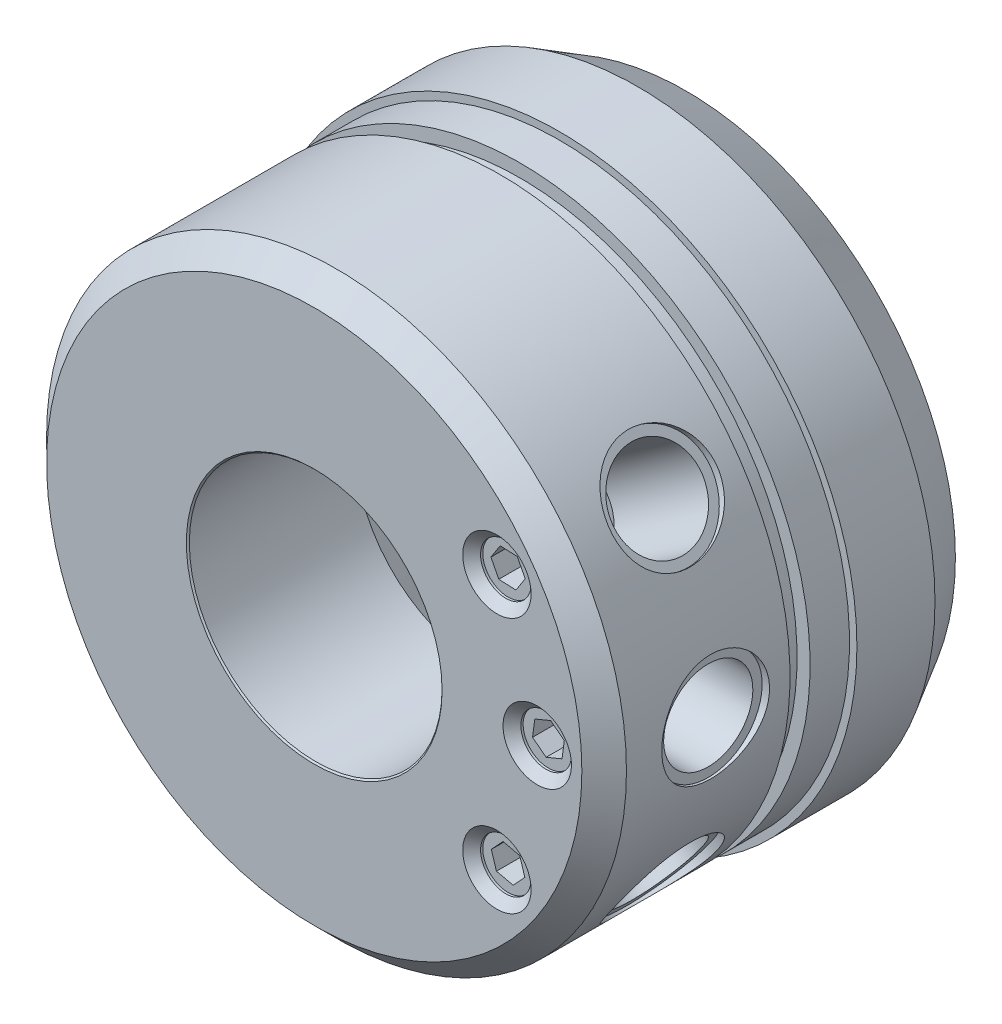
ISO-10303-21;
HEADER;
FILE_DESCRIPTION(('STEP AP214'),'2;1');
FILE_NAME('part.step','',(''),(''),'','','');
FILE_SCHEMA(('AUTOMOTIVE_DESIGN { 1 0 10303 214 1 1 1 1 }'));
ENDSEC;
DATA;
#1=APPLICATION_CONTEXT('core data for automotive mechanical design processes');
#2=APPLICATION_PROTOCOL_DEFINITION('international standard','automotive_design',2000,#1);
#3=PRODUCT_CONTEXT('',#1,'mechanical');
#4=PRODUCT('Part','Part','',(#3));
#5=PRODUCT_RELATED_PRODUCT_CATEGORY('part','',(#4));
#6=PRODUCT_DEFINITION_FORMATION('','',#4);
#7=PRODUCT_DEFINITION_CONTEXT('part definition',#1,'design');
#8=PRODUCT_DEFINITION('design','',#6,#7);
#9=PRODUCT_DEFINITION_SHAPE('','',#8);
#10=(LENGTH_UNIT() NAMED_UNIT(*) SI_UNIT(.MILLI.,.METRE.));
#11=(NAMED_UNIT(*) PLANE_ANGLE_UNIT() SI_UNIT($,.RADIAN.));
#12=(NAMED_UNIT(*) SI_UNIT($,.STERADIAN.) SOLID_ANGLE_UNIT());
#13=UNCERTAINTY_MEASURE_WITH_UNIT(LENGTH_MEASURE(1.E-05),#10,'distance_accuracy_value','');
#14=(GEOMETRIC_REPRESENTATION_CONTEXT(3) GLOBAL_UNCERTAINTY_ASSIGNED_CONTEXT((#13)) GLOBAL_UNIT_ASSIGNED_CONTEXT((#10,
#11,#12)) REPRESENTATION_CONTEXT('',''));
#15=CARTESIAN_POINT('',(0.,0.,0.));
#16=DIRECTION('',(0.,0.,1.));
#17=DIRECTION('',(1.,0.,0.));
#18=AXIS2_PLACEMENT_3D('',#15,#16,#17);
#19=CARTESIAN_POINT('',(0.,0.,0.));
#20=DIRECTION('',(0.,0.,-1.));
#21=DIRECTION('',(-1.,0.,0.));
#22=AXIS2_PLACEMENT_3D('',#19,#20,#21);
#23=CYLINDRICAL_SURFACE('',#22,39.);
#24=CARTESIAN_POINT('',(38.3201970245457,7.25,35.));
#25=CARTESIAN_POINT('',(38.3201951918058,7.25000361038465,35.2017896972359));
#26=CARTESIAN_POINT('',(38.3217939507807,7.24157297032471,35.4035327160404));
#27=CARTESIAN_POINT('',(38.3281379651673,7.20792312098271,35.8056251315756));
#28=CARTESIAN_POINT('',(38.3328837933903,7.18270085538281,36.0059742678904));
#29=CARTESIAN_POINT('',(38.3453884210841,7.11564066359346,36.4038866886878));
#30=CARTESIAN_POINT('',(38.3531489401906,7.07379325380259,36.6014483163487));
#31=CARTESIAN_POINT('',(38.3714583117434,6.97379166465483,36.9923460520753));
#32=CARTESIAN_POINT('',(38.3820081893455,6.91563148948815,37.185680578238));
#33=CARTESIAN_POINT('',(38.40557336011,6.78354074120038,37.5664431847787));
#34=CARTESIAN_POINT('',(38.4185854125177,6.709630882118,37.7538786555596));
#35=CARTESIAN_POINT('',(38.4467164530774,6.54651369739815,38.1218877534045));
#36=CARTESIAN_POINT('',(38.4618362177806,6.45730073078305,38.3024588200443));
#37=CARTESIAN_POINT('',(38.4937435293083,6.26428509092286,38.6553608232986));
#38=CARTESIAN_POINT('',(38.5105302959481,6.16048923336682,38.8276955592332));
#39=CARTESIAN_POINT('',(38.5453145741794,5.93896411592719,39.1631259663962));
#40=CARTESIAN_POINT('',(38.5633125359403,5.82122966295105,39.3262181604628));
#41=CARTESIAN_POINT('',(38.6002099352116,5.57134693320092,39.6436872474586));
#42=CARTESIAN_POINT('',(38.6191169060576,5.43905909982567,39.7979534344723));
#43=CARTESIAN_POINT('',(38.657129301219,5.16196783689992,40.0948837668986));
#44=CARTESIAN_POINT('',(38.6762347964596,5.01715978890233,40.237543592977));
#45=CARTESIAN_POINT('',(38.7140982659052,4.71610012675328,40.5101841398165));
#46=CARTESIAN_POINT('',(38.7328563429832,4.55985197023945,40.640168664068));
#47=CARTESIAN_POINT('',(38.7695155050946,4.23687230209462,40.8866540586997));
#48=CARTESIAN_POINT('',(38.787416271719,4.07013694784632,41.003149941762));
#49=CARTESIAN_POINT('',(38.8219808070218,3.72611128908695,41.2225817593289));
#50=CARTESIAN_POINT('',(38.8386345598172,3.54875264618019,41.3254121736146));
#51=CARTESIAN_POINT('',(38.8700866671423,3.18583310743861,41.5157464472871));
#52=CARTESIAN_POINT('',(38.8848850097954,3.00027215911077,41.6032502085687));
#53=CARTESIAN_POINT('',(38.9122035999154,2.62227209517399,41.7622649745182));
#54=CARTESIAN_POINT('',(38.9247240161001,2.42983349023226,41.8337771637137));
#55=CARTESIAN_POINT('',(38.9471295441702,2.03944196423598,41.9602641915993));
#56=CARTESIAN_POINT('',(38.9570146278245,1.84148898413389,42.0152388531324));
#57=CARTESIAN_POINT('',(38.9737664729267,1.44383634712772,42.1076731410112));
#58=CARTESIAN_POINT('',(38.9806669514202,1.2441836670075,42.1453287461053));
#59=CARTESIAN_POINT('',(38.9914222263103,0.842274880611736,42.2037719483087));
#60=CARTESIAN_POINT('',(38.9952759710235,0.640017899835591,42.22455372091));
#61=CARTESIAN_POINT('',(38.9998212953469,0.234511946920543,42.2490497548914));
#62=CARTESIAN_POINT('',(39.0005142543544,0.0312634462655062,42.2527714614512));
#63=CARTESIAN_POINT('',(38.9987290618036,-0.374836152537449,42.2431575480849));
#64=CARTESIAN_POINT('',(38.9962497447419,-0.57768707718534,42.2298156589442));
#65=CARTESIAN_POINT('',(38.9842252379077,-1.17827816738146,42.1648134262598));
#66=CARTESIAN_POINT('',(38.9701517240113,-1.5735586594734,42.0884977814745));
#67=CARTESIAN_POINT('',(38.9313367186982,-2.34538232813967,41.8718711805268));
#68=CARTESIAN_POINT('',(38.9065948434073,-2.72192482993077,41.7315579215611));
#69=CARTESIAN_POINT('',(38.8489741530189,-3.44828538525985,41.3901229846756));
#70=CARTESIAN_POINT('',(38.8160508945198,-3.7979433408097,41.188667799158));
#71=CARTESIAN_POINT('',(38.7457078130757,-4.45878641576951,40.7309133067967));
#72=CARTESIAN_POINT('',(38.7082875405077,-4.76996768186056,40.4746085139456));
#73=CARTESIAN_POINT('',(38.6324313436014,-5.34997432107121,39.9098418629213));
#74=CARTESIAN_POINT('',(38.5939886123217,-5.61809044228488,39.6006519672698));
#75=CARTESIAN_POINT('',(38.5209598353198,-6.09876604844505,38.9413193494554));
#76=CARTESIAN_POINT('',(38.4863738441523,-6.31132474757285,38.5911760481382));
#77=CARTESIAN_POINT('',(38.4249651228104,-6.67505038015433,37.85894499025));
#78=CARTESIAN_POINT('',(38.3981552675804,-6.82611566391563,37.4768055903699));
#79=CARTESIAN_POINT('',(38.3555326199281,-7.06169898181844,36.6919597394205));
#80=CARTESIAN_POINT('',(38.3397186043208,-7.14622441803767,36.2892555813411));
#81=CARTESIAN_POINT('',(38.3211197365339,-7.24529615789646,35.4811037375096));
#82=CARTESIAN_POINT('',(38.3181452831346,-7.26086089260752,35.0757851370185));
#83=CARTESIAN_POINT('',(38.3250551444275,-7.22429800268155,34.2683400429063));
#84=CARTESIAN_POINT('',(38.3349388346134,-7.17217366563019,33.8662133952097));
#85=CARTESIAN_POINT('',(38.3662748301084,-7.00258646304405,33.0799062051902));
#86=CARTESIAN_POINT('',(38.3876327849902,-6.88565623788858,32.6956066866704));
#87=CARTESIAN_POINT('',(38.4394297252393,-6.59033968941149,31.9520542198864));
#88=CARTESIAN_POINT('',(38.4698693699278,-6.4119489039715,31.5928030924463));
#89=CARTESIAN_POINT('',(38.5368322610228,-5.99643157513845,30.9050562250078));
#90=CARTESIAN_POINT('',(38.5734206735,-5.75866097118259,30.5769561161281));
#91=CARTESIAN_POINT('',(38.6483750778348,-5.23198327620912,29.964939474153));
#92=CARTESIAN_POINT('',(38.6867412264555,-4.94307166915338,29.681026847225));
#93=CARTESIAN_POINT('',(38.7615349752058,-4.31784235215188,29.1616660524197));
#94=CARTESIAN_POINT('',(38.7979305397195,-3.98095243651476,28.9269025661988));
#95=CARTESIAN_POINT('',(38.864152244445,-3.27169519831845,28.5172580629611));
#96=CARTESIAN_POINT('',(38.8939786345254,-2.89932922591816,28.3423747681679));
#97=CARTESIAN_POINT('',(38.9311948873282,-2.32361083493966,28.1294000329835));
#98=CARTESIAN_POINT('',(38.9423311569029,-2.12926115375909,28.0667122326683));
#99=CARTESIAN_POINT('',(38.9618460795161,-1.73586099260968,27.9579226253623));
#100=CARTESIAN_POINT('',(38.9702257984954,-1.53681236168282,27.9118144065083));
#101=CARTESIAN_POINT('',(38.9839873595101,-1.13538728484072,27.8365418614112));
#102=CARTESIAN_POINT('',(38.9893683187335,-0.933009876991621,27.8073825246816));
#103=CARTESIAN_POINT('',(38.9969749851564,-0.526530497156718,27.7662616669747));
#104=CARTESIAN_POINT('',(38.9992019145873,-0.322429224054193,27.7542934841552));
#105=CARTESIAN_POINT('',(39.0004308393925,0.0830569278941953,27.7476821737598));
#106=CARTESIAN_POINT('',(38.9994797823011,0.284437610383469,27.7527868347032));
#107=CARTESIAN_POINT('',(38.9944835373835,0.685967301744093,27.7797215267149));
#108=CARTESIAN_POINT('',(38.9904394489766,0.886116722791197,27.8015456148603));
#109=CARTESIAN_POINT('',(38.9793700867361,1.28386045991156,27.8617462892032));
#110=CARTESIAN_POINT('',(38.9723443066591,1.48145433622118,27.9001256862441));
#111=CARTESIAN_POINT('',(38.9555067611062,1.87265179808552,27.9931393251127));
#112=CARTESIAN_POINT('',(38.9456950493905,2.0662554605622,28.0477732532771));
#113=CARTESIAN_POINT('',(38.9235756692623,2.44779791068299,28.1727738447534));
#114=CARTESIAN_POINT('',(38.9112723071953,2.63574583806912,28.2431133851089));
#115=CARTESIAN_POINT('',(38.8844961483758,3.00503517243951,28.3990578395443));
#116=CARTESIAN_POINT('',(38.8700233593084,3.18637660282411,28.4846626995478));
#117=CARTESIAN_POINT('',(38.8392987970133,3.54127157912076,28.6705426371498));
#118=CARTESIAN_POINT('',(38.8230466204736,3.71482334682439,28.7708210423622));
#119=CARTESIAN_POINT('',(38.7892125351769,4.05288086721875,28.9852918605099));
#120=CARTESIAN_POINT('',(38.77163108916,4.21738973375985,29.0994794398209));
#121=CARTESIAN_POINT('',(38.7353476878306,4.53865083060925,29.3427629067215));
#122=CARTESIAN_POINT('',(38.7166332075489,4.69525653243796,29.4720504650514));
#123=CARTESIAN_POINT('',(38.6788460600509,4.99699753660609,29.7432283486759));
#124=CARTESIAN_POINT('',(38.6597735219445,5.14213687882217,29.8851141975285));
#125=CARTESIAN_POINT('',(38.6217831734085,5.42010695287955,30.1806517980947));
#126=CARTESIAN_POINT('',(38.6028654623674,5.55293026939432,30.3343105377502));
#127=CARTESIAN_POINT('',(38.5657332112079,5.80521124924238,30.6522205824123));
#128=CARTESIAN_POINT('',(38.5475184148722,5.92467381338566,30.8164679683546));
#129=CARTESIAN_POINT('',(38.512131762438,6.15052042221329,31.1560985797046));
#130=CARTESIAN_POINT('',(38.4949714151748,6.2567699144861,31.3315725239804));
#131=CARTESIAN_POINT('',(38.46238830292,6.45404379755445,31.6909483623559));
#132=CARTESIAN_POINT('',(38.4469648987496,6.54507379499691,31.8748471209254));
#133=CARTESIAN_POINT('',(38.4183109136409,6.71122185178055,32.2497272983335));
#134=CARTESIAN_POINT('',(38.4050789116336,6.78635023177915,32.4407040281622));
#135=CARTESIAN_POINT('',(38.3811906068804,6.92017425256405,32.8284200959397));
#136=CARTESIAN_POINT('',(38.3705337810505,6.97887323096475,33.0251582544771));
#137=CARTESIAN_POINT('',(38.347917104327,7.1023165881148,33.5138022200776));
#138=CARTESIAN_POINT('',(38.3375764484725,7.15762650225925,33.80822118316));
#139=CARTESIAN_POINT('',(38.3237178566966,7.23146504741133,34.4017943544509));
#140=CARTESIAN_POINT('',(38.3201997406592,7.2499946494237,34.7009484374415));
#141=CARTESIAN_POINT('',(38.3201970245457,7.25,35.));
#142=B_SPLINE_CURVE_WITH_KNOTS('',3,(#24,#25,#26,#27,#28,#29,#30,#31,#32,#33,#34,#35,#36,#37,
#38,#39,#40,#41,#42,#43,#44,#45,#46,#47,#48,#49,#50,#51,#52,#53,#54,#55,#56,#57,#58,#59,#60,#61,
#62,#63,#64,#65,#66,#67,#68,#69,#70,#71,#72,#73,#74,#75,#76,#77,#78,#79,#80,#81,#82,#83,#84,#85,
#86,#87,#88,#89,#90,#91,#92,#93,#94,#95,#96,#97,#98,#99,#100,#101,#102,#103,#104,#105,#106,#107,
#108,#109,#110,#111,#112,#113,#114,#115,#116,#117,#118,#119,#120,#121,#122,#123,#124,#125,#126,
#127,#128,#129,#130,#131,#132,#133,#134,#135,#136,#137,#138,#139,#140,#141),.UNSPECIFIED.,.T.,
.F.,(4,2,2,2,2,2,2,2,2,2,2,2,2,2,2,2,2,2,2,2,2,2,2,2,2,2,2,2,2,2,2,2,2,2,2,2,2,2,2,2,2,2,2,2,2,
2,2,2,2,2,2,2,2,2,2,2,2,2,4),(0.,0.605106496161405,1.21032316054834,1.81588555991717,
2.42167082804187,3.02666422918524,3.63188112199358,4.23681608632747,4.84197714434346,
5.45355284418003,6.06535511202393,6.6769732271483,7.28881676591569,7.90513977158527,
8.52146672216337,9.13774800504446,9.75403588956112,10.3631671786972,10.9725086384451,
11.5815841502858,12.1908835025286,13.393159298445,14.5954783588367,15.8044772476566,
17.013597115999,18.240944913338,19.4683100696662,20.6976959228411,21.9269449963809,
23.1379783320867,24.3489528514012,25.5501188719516,26.7513721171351,27.9662681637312,
29.1812715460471,30.4122148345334,31.6431112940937,32.2560386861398,32.8687287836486,
33.4815991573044,34.0942319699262,34.6978547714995,35.3012631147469,35.9047739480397,
36.5082731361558,37.110738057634,37.7132008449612,38.3158004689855,38.9181912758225,
39.5292912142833,40.1401748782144,40.751423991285,41.3624481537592,41.9792581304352,
42.5958403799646,43.2120212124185,43.8280767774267,44.7248659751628,45.6216314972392),.UNSPECIFIED.);
#143=CARTESIAN_POINT('',(38.3201970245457,7.25,35.));
#144=VERTEX_POINT('',#143);
#145=EDGE_CURVE('E263',#144,#144,#142,.T.);
#146=ORIENTED_EDGE('',*,*,#145,.F.);
#147=EDGE_LOOP('',(#146));
#148=FACE_BOUND('',#147,.T.);
#149=CARTESIAN_POINT('',(35.5484968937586,-16.0407097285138,35.));
#150=CARTESIAN_POINT('',(35.5484974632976,-16.0407057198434,35.2017896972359));
#151=CARTESIAN_POINT('',(35.5449714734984,-16.0485287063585,35.4035327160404));
#152=CARTESIAN_POINT('',(35.5308674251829,-16.0797318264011,35.8056251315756));
#153=CARTESIAN_POINT('',(35.5202880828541,-16.1031147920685,36.0059742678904));
#154=CARTESIAN_POINT('',(35.492067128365,-16.1652196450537,36.4038866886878));
#155=CARTESIAN_POINT('',(35.4744214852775,-16.2039502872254,36.6014483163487));
#156=CARTESIAN_POINT('',(35.4320610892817,-16.296368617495,36.9923460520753));
#157=CARTESIAN_POINT('',(35.4073437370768,-16.3500618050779,37.185680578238));
#158=CARTESIAN_POINT('',(35.3508830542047,-16.4717806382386,37.5664431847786));
#159=CARTESIAN_POINT('',(35.3191489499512,-16.5397874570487,37.7538786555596));
#160=CARTESIAN_POINT('',(35.2486323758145,-16.6895405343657,38.1218877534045));
#161=CARTESIAN_POINT('',(35.2098473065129,-16.7712918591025,38.3024588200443));
#162=CARTESIAN_POINT('',(35.1252750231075,-16.9477022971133,38.6553608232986));
#163=CARTESIAN_POINT('',(35.0794910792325,-17.0423553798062,38.8276955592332));
#164=CARTESIAN_POINT('',(34.9809231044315,-17.2437695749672,39.1631259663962));
#165=CARTESIAN_POINT('',(34.9281364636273,-17.3505351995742,39.3262181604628));
#166=CARTESIAN_POINT('',(34.8150341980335,-17.5763906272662,39.6436872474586));
#167=CARTESIAN_POINT('',(34.7546446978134,-17.6955990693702,39.7979534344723));
#168=CARTESIAN_POINT('',(34.6268496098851,-17.9443819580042,40.0948837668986));
#169=CARTESIAN_POINT('',(34.5594414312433,-18.0739602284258,40.237543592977));
#170=CARTESIAN_POINT('',(34.417776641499,-18.3422914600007,40.5101841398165));
#171=CARTESIAN_POINT('',(34.3435220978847,-18.4810416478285,40.640168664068));
#172=CARTESIAN_POINT('',(34.1882979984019,-18.7666379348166,40.8866540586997));
#173=CARTESIAN_POINT('',(34.1073259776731,-18.9134869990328,41.003149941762));
#174=CARTESIAN_POINT('',(33.9383145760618,-19.2151217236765,41.2225817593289));
#175=CARTESIAN_POINT('',(33.8502277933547,-19.3699576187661,41.3254121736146));
#176=CARTESIAN_POINT('',(33.6678297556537,-19.6852840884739,41.5157464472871));
#177=CARTESIAN_POINT('',(33.5735184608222,-19.8457746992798,41.6032502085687));
#178=CARTESIAN_POINT('',(33.3790846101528,-20.1710835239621,41.7622649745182));
#179=CARTESIAN_POINT('',(33.278962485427,-20.3359014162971,41.8337771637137));
#180=CARTESIAN_POINT('',(33.0733966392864,-20.6685427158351,41.9602641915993));
#181=CARTESIAN_POINT('',(32.9679528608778,-20.8363661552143,42.0152388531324));
#182=CARTESIAN_POINT('',(32.7535909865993,-21.1717125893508,42.1076731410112));
#183=CARTESIAN_POINT('',(32.6447274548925,-21.3392164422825,42.1453287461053));
#184=CARTESIAN_POINT('',(32.4230122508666,-21.6746098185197,42.2037719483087));
#185=CARTESIAN_POINT('',(32.3101592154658,-21.8424994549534,42.22455372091));
#186=CARTESIAN_POINT('',(32.0812938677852,-22.1772775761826,42.2490497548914));
#187=CARTESIAN_POINT('',(31.9652829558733,-22.3441664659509,42.2527714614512));
#188=CARTESIAN_POINT('',(31.730891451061,-22.6757998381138,42.2431575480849));
#189=CARTESIAN_POINT('',(31.6125100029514,-22.8405435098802,42.2298156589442));
#190=CARTESIAN_POINT('',(31.2581752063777,-23.3256219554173,42.1648134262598));
#191=CARTESIAN_POINT('',(31.0199232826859,-23.6413445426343,42.0884977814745));
#192=CARTESIAN_POINT('',(30.5454280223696,-24.2513221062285,41.8718711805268));
#193=CARTESIAN_POINT('',(30.3091847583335,-24.5455763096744,41.7315579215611));
#194=CARTESIAN_POINT('',(29.8453613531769,-25.10752617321,41.3901229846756));
#195=CARTESIAN_POINT('',(29.6178366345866,-25.3750651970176,41.188667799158));
#196=CARTESIAN_POINT('',(29.1811709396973,-25.8760490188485,40.7309133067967));
#197=CARTESIAN_POINT('',(28.9720318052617,-26.1094904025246,40.4746085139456));
#198=CARTESIAN_POINT('',(28.5772159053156,-26.5410946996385,39.9098418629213));
#199=CARTESIAN_POINT('',(28.3919403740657,-26.7386727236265,39.6006519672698));
#200=CARTESIAN_POINT('',(28.0564145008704,-27.0905315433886,38.9413193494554));
#201=CARTESIAN_POINT('',(27.9061646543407,-27.244811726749,38.5911760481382));
#202=CARTESIAN_POINT('',(27.6472371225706,-27.5075357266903,37.85894499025));
#203=CARTESIAN_POINT('',(27.5386282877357,-27.6159036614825,37.4768055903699));
#204=CARTESIAN_POINT('',(27.3685888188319,-27.7844348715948,36.6919597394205));
#205=CARTESIAN_POINT('',(27.3071529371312,-27.8446035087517,36.289255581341));
#206=CARTESIAN_POINT('',(27.2350924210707,-27.9150904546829,35.4811037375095));
#207=CARTESIAN_POINT('',(27.2237283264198,-27.9261342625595,35.0757851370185));
#208=CARTESIAN_POINT('',(27.25036016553,-27.9001470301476,34.2683400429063));
#209=CARTESIAN_POINT('',(27.288353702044,-27.8631183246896,33.8662133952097));
#210=CARTESIAN_POINT('',(27.4112938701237,-27.7421742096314,33.0799062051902));
#211=CARTESIAN_POINT('',(27.4958577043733,-27.658640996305,32.6956066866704));
#212=CARTESIAN_POINT('',(27.7076738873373,-27.4464413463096,31.9520542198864));
#213=CARTESIAN_POINT('',(27.8349293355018,-27.3177716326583,31.5928030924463));
#214=CARTESIAN_POINT('',(28.1281130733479,-27.0158080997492,30.9050562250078));
#215=CARTESIAN_POINT('',(28.294464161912,-26.8420240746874,30.5769561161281));
#216=CARTESIAN_POINT('',(28.6579531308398,-26.4535870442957,29.964939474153));
#217=CARTESIAN_POINT('',(28.8550937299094,-26.2389304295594,29.681026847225));
#218=CARTESIAN_POINT('',(29.2749779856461,-25.7696724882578,29.1616660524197));
#219=CARTESIAN_POINT('',(29.4980236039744,-25.5145840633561,28.9269025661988));
#220=CARTESIAN_POINT('',(29.9590824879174,-24.9715777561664,28.5172580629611));
#221=CARTESIAN_POINT('',(30.1970951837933,-24.6836611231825,28.3423747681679));
#222=CARTESIAN_POINT('',(30.5577994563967,-24.2334065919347,28.1294000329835));
#223=CARTESIAN_POINT('',(30.6783961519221,-24.0805921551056,28.0667122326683));
#224=CARTESIAN_POINT('',(30.9200269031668,-23.7695309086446,27.9579226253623));
#225=CARTESIAN_POINT('',(31.0410607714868,-23.6112862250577,27.9118144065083));
#226=CARTESIAN_POINT('',(31.2825815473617,-23.2903513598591,27.8365418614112));
#227=CARTESIAN_POINT('',(31.4030682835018,-23.1276598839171,27.8073825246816));
#228=CARTESIAN_POINT('',(31.6424462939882,-22.7990544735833,27.7662616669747));
#229=CARTESIAN_POINT('',(31.7613381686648,-22.6331418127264,27.7542934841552));
#230=CARTESIAN_POINT('',(31.9949221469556,-22.3016918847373,27.7476821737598));
#231=CARTESIAN_POINT('',(32.1096503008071,-22.1361849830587,27.7527868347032));
#232=CARTESIAN_POINT('',(32.3358655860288,-21.8044053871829,27.7797215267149));
#233=CARTESIAN_POINT('',(32.447353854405,-21.6381329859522,27.8015456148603));
#234=CARTESIAN_POINT('',(32.6664227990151,-21.3059712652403,27.8617462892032));
#235=CARTESIAN_POINT('',(32.7740028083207,-21.1400820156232,27.9001256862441));
#236=CARTESIAN_POINT('',(32.984591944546,-20.8099741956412,27.9931393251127));
#237=CARTESIAN_POINT('',(33.087601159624,-20.6457555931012,28.0477732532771));
#238=CARTESIAN_POINT('',(33.2883257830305,-20.3205271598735,28.1727738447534));
#239=CARTESIAN_POINT('',(33.3860499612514,-20.1595123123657,28.2431133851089));
#240=CARTESIAN_POINT('',(33.5759318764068,-19.8416500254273,28.3990578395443));
#241=CARTESIAN_POINT('',(33.6680896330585,-19.6848025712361,28.4846626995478));
#242=CARTESIAN_POINT('',(33.8464809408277,-19.3764667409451,28.6705426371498));
#243=CARTESIAN_POINT('',(33.9327131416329,-19.2249795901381,28.7708210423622));
#244=CARTESIAN_POINT('',(34.098899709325,-18.9286526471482,28.9852918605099));
#245=CARTESIAN_POINT('',(34.1788562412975,-18.7838105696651,29.0994794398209));
#246=CARTESIAN_POINT('',(34.3334024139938,-18.4998375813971,29.3427629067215));
#247=CARTESIAN_POINT('',(34.4078977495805,-18.3608195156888,29.4720504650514));
#248=CARTESIAN_POINT('',(34.5500158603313,-18.0919739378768,29.7432283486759));
#249=CARTESIAN_POINT('',(34.6176410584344,-17.9621431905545,29.8851141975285));
#250=CARTESIAN_POINT('',(34.7459582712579,-17.7126530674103,30.1806517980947));
#251=CARTESIAN_POINT('',(34.8066461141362,-17.592999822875,30.3343105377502));
#252=CARTESIAN_POINT('',(34.9209315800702,-17.3650451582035,30.6522205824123));
#253=CARTESIAN_POINT('',(34.9745318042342,-17.2567395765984,30.8164679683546));
#254=CARTESIAN_POINT('',(35.0750850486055,-17.0514399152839,31.1560985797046));
#255=CARTESIAN_POINT('',(35.1219703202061,-16.9545626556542,31.3315725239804));
#256=CARTESIAN_POINT('',(35.2084314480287,-16.7742764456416,31.6909483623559));
#257=CARTESIAN_POINT('',(35.2480099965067,-16.6908625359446,31.8748471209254));
#258=CARTESIAN_POINT('',(35.3198366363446,-16.5383267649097,32.2497272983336));
#259=CARTESIAN_POINT('',(35.3520894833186,-16.4691956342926,32.4407040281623));
#260=CARTESIAN_POINT('',(35.4092796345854,-16.3458716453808,32.8284200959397));
#261=CARTESIAN_POINT('',(35.4342184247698,-16.2916757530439,33.0251582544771));
#262=CARTESIAN_POINT('',(35.486496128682,-16.1775844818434,33.5138022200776));
#263=CARTESIAN_POINT('',(35.5097500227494,-16.126346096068,33.80822118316));
#264=CARTESIAN_POINT('',(35.5407497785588,-16.0579121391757,34.4017943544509));
#265=CARTESIAN_POINT('',(35.548496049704,-16.040715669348,34.7009484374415));
#266=CARTESIAN_POINT('',(35.5484968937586,-16.0407097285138,35.));
#267=B_SPLINE_CURVE_WITH_KNOTS('',3,(#149,#150,#151,#152,#153,#154,#155,#156,#157,#158,#159,
#160,#161,#162,#163,#164,#165,#166,#167,#168,#169,#170,#171,#172,#173,#174,#175,#176,#177,#178,
#179,#180,#181,#182,#183,#184,#185,#186,#187,#188,#189,#190,#191,#192,#193,#194,#195,#196,#197,
#198,#199,#200,#201,#202,#203,#204,#205,#206,#207,#208,#209,#210,#211,#212,#213,#214,#215,#216,
#217,#218,#219,#220,#221,#222,#223,#224,#225,#226,#227,#228,#229,#230,#231,#232,#233,#234,#235,
#236,#237,#238,#239,#240,#241,#242,#243,#244,#245,#246,#247,#248,#249,#250,#251,#252,#253,#254,
#255,#256,#257,#258,#259,#260,#261,#262,#263,#264,#265,#266),.UNSPECIFIED.,.T.,.F.,(4,2,2,2,2,2,
2,2,2,2,2,2,2,2,2,2,2,2,2,2,2,2,2,2,2,2,2,2,2,2,2,2,2,2,2,2,2,2,2,2,2,2,2,2,2,2,2,2,2,2,2,2,2,2,
2,2,2,2,4),(0.,0.605106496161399,1.21032316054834,1.81588555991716,2.42167082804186,
3.02666422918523,3.63188112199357,4.23681608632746,4.84197714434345,5.45355284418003,
6.06535511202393,6.6769732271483,7.28881676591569,7.90513977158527,8.52146672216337,
9.13774800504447,9.75403588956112,10.3631671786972,10.9725086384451,11.5815841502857,
12.1908835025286,13.393159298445,14.5954783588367,15.8044772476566,17.013597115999,
18.240944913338,19.4683100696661,20.6976959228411,21.9269449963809,23.1379783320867,
24.3489528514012,25.5501188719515,26.7513721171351,27.9662681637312,29.1812715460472,
30.4122148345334,31.6431112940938,32.2560386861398,32.8687287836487,33.4815991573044,
34.0942319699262,34.6978547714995,35.3012631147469,35.9047739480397,36.5082731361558,
37.110738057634,37.7132008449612,38.3158004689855,38.9181912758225,39.5292912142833,
40.1401748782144,40.751423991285,41.3624481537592,41.9792581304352,42.5958403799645,
43.2120212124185,43.8280767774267,44.7248659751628,45.6216314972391),.UNSPECIFIED.);
#268=CARTESIAN_POINT('',(35.5484968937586,-16.0407097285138,35.));
#269=VERTEX_POINT('',#268);
#270=EDGE_CURVE('E271',#269,#269,#267,.T.);
#271=ORIENTED_EDGE('',*,*,#270,.F.);
#272=EDGE_LOOP('',(#271));
#273=FACE_BOUND('',#272,.T.);
#274=CARTESIAN_POINT('',(27.2316385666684,27.9184143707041,35.));
#275=CARTESIAN_POINT('',(27.2316349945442,27.9184162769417,35.2017896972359));
#276=CARTESIAN_POINT('',(27.2377802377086,27.9124273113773,35.4035327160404));
#277=CARTESIAN_POINT('',(27.2622777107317,27.8885017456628,35.8056251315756));
#278=CARTESIAN_POINT('',(27.2806321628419,27.8705629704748,36.0059742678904));
#279=CARTESIAN_POINT('',(27.3293395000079,27.8228028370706,36.4038866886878));
#280=CARTESIAN_POINT('',(27.3596992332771,27.7929746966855,36.6014483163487));
#281=CARTESIAN_POINT('',(27.432055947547,27.7215600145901,36.9923460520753));
#282=CARTESIAN_POINT('',(27.4740572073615,27.679969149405,37.185680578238));
#283=CARTESIAN_POINT('',(27.5691248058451,27.5852831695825,37.5664431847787));
#284=CARTESIAN_POINT('',(27.6221766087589,27.5322031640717,37.7538786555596));
#285=CARTESIAN_POINT('',(27.7387803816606,27.4147206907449,38.1218877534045));
#286=CARTESIAN_POINT('',(27.8023362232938,27.3503140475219,38.3024588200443));
#287=CARTESIAN_POINT('',(27.9391823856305,27.2105061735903,38.6553608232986));
#288=CARTESIAN_POINT('',(28.0124681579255,27.1351100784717,38.8276955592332));
#289=CARTESIAN_POINT('',(28.168023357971,26.9735987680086,39.1631259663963));
#290=CARTESIAN_POINT('',(28.2502961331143,26.8874795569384,39.3262181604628));
#291=CARTESIAN_POINT('',(28.4238475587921,26.7039510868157,39.6436872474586));
#292=CARTESIAN_POINT('',(28.5152124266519,26.6064318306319,39.7979534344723));
#293=CARTESIAN_POINT('',(28.7052833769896,26.4012549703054,40.0948837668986));
#294=CARTESIAN_POINT('',(28.8039921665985,26.2935936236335,40.2375435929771));
#295=CARTESIAN_POINT('',(29.0076888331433,26.0686975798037,40.5101841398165));
#296=CARTESIAN_POINT('',(29.1126748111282,25.9514657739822,40.640168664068));
#297=CARTESIAN_POINT('',(29.3279577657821,25.707923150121,40.8866540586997));
#298=CARTESIAN_POINT('',(29.4382566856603,25.5816090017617,41.003149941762));
#299=CARTESIAN_POINT('',(29.663895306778,25.3196250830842,41.2225817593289));
#300=CARTESIAN_POINT('',(29.7792660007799,25.183893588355,41.3254121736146));
#301=CARTESIAN_POINT('',(30.013192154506,24.9046474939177,41.5157464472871));
#302=CARTESIAN_POINT('',(30.1317476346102,24.7611328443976,41.6032502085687));
#303=CARTESIAN_POINT('',(30.3709376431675,24.4671626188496,41.7622649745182));
#304=CARTESIAN_POINT('',(30.4915720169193,24.3167075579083,41.8337771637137));
#305=CARTESIAN_POINT('',(30.7338449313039,24.0097688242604,41.9602641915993));
#306=CARTESIAN_POINT('',(30.8554834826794,23.8532850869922,42.0152388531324));
#307=CARTESIAN_POINT('',(31.09728997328,23.5371555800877,42.1076731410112));
#308=CARTESIAN_POINT('',(31.2174585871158,23.3775676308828,42.1453287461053));
#309=CARTESIAN_POINT('',(31.456794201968,23.0545121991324,42.2037719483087));
#310=CARTESIAN_POINT('',(31.5759608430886,22.8910433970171,42.22455372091));
#311=CARTESIAN_POINT('',(31.8122728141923,22.5614794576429,42.2490497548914));
#312=CARTESIAN_POINT('',(31.9294190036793,22.3953854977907,42.2527714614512));
#313=CARTESIAN_POINT('',(32.1608858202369,22.0617042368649,42.2431575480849));
#314=CARTESIAN_POINT('',(32.2752053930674,21.8941164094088,42.2298156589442));
#315=CARTESIAN_POINT('',(32.6098403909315,21.3952440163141,42.1648134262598));
#316=CARTESIAN_POINT('',(32.8250356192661,21.0633769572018,42.0884977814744));
#317=CARTESIAN_POINT('',(33.2359400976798,20.4088726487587,41.8718711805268));
#318=CARTESIAN_POINT('',(33.4316486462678,20.0862357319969,41.7315579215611));
#319=CARTESIAN_POINT('',(33.8010718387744,19.4581861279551,41.3901229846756));
#320=CARTESIAN_POINT('',(33.9746582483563,19.1528790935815,41.188667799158));
#321=CARTESIAN_POINT('',(34.2960805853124,18.5712010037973,40.7309133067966));
#322=CARTESIAN_POINT('',(34.4439139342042,18.2948328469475,40.4746085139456));
#323=CARTESIAN_POINT('',(34.7144543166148,17.7762098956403,39.9098418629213));
#324=CARTESIAN_POINT('',(34.836748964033,17.5345321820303,39.6006519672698));
#325=CARTESIAN_POINT('',(35.0526314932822,17.0988981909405,38.9413193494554));
#326=CARTESIAN_POINT('',(35.1462189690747,16.904942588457,38.5911760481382));
#327=CARTESIAN_POINT('',(35.3045403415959,16.5717733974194,37.85894499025));
#328=CARTESIAN_POINT('',(35.3692264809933,16.4326504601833,37.4768055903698));
#329=CARTESIAN_POINT('',(35.4694370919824,16.2152245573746,36.6919597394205));
#330=CARTESIAN_POINT('',(35.5049648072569,16.1369148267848,36.289255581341));
#331=CARTESIAN_POINT('',(35.5465547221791,16.0450921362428,35.4811037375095));
#332=CARTESIAN_POINT('',(35.5530457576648,16.0306361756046,35.0757851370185));
#333=CARTESIAN_POINT('',(35.5377343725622,16.0645500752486,34.2683400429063));
#334=CARTESIAN_POINT('',(35.51593332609,16.1129168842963,33.8662133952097));
#335=CARTESIAN_POINT('',(35.4443310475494,16.2698081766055,33.0799062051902));
#336=CARTESIAN_POINT('',(35.3947580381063,16.3778422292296,32.6956066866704));
#337=CARTESIAN_POINT('',(35.2678009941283,16.649460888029,31.9520542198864));
#338=CARTESIAN_POINT('',(35.1904149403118,16.8130495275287,31.5928030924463));
#339=CARTESIAN_POINT('',(35.0069367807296,17.1918297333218,30.9050562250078));
#340=CARTESIAN_POINT('',(34.9005286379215,17.4075862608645,30.5769561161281));
#341=CARTESIAN_POINT('',(34.6598377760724,17.8820074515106,29.964939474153));
#342=CARTESIAN_POINT('',(34.525552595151,18.1406759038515,29.681026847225));
#343=CARTESIAN_POINT('',(34.2282032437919,18.6957337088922,29.1616660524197));
#344=CARTESIAN_POINT('',(34.0647846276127,18.9925734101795,28.9269025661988));
#345=CARTESIAN_POINT('',(33.712217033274,19.6115461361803,28.5172580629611));
#346=CARTESIAN_POINT('',(33.5230690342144,19.9336781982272,28.3423747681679));
#347=CARTESIAN_POINT('',(33.2233363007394,20.426625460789,28.1294000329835));
#348=CARTESIAN_POINT('',(33.1209842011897,20.5922149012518,28.0667122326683));
#349=CARTESIAN_POINT('',(32.9113248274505,20.9256627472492,27.9579226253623));
#350=CARTESIAN_POINT('',(32.8040194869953,21.0935202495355,27.9118144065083));
#351=CARTESIAN_POINT('',(32.5850443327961,21.4302417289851,27.8365418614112));
#352=CARTESIAN_POINT('',(32.4733732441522,21.5991059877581,27.8073825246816));
#353=CARTESIAN_POINT('',(32.2464572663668,21.9364374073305,27.7662616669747));
#354=CARTESIAN_POINT('',(32.1312137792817,22.1049046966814,27.7542934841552));
#355=CARTESIAN_POINT('',(31.899643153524,22.4377643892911,27.7476821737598));
#356=CARTESIAN_POINT('',(31.7833568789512,22.6021802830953,27.7527868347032));
#357=CARTESIAN_POINT('',(31.5489562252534,22.9282284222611,27.7797215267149));
#358=CARTESIAN_POINT('',(31.4308425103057,23.0898616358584,27.8015456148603));
#359=CARTESIAN_POINT('',(31.1936385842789,23.409325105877,27.8617462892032));
#360=CARTESIAN_POINT('',(31.0745482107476,23.5671547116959,27.9001256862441));
#361=CARTESIAN_POINT('',(30.8363740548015,23.8779472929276,27.9931393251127));
#362=CARTESIAN_POINT('',(30.7172902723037,24.0309103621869,28.0477732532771));
#363=CARTESIAN_POINT('',(30.4803273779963,24.3307644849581,28.1727738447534));
#364=CARTESIAN_POINT('',(30.3624465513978,24.4776654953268,28.2431133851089));
#365=CARTESIAN_POINT('',(30.128697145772,24.7648114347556,28.3990578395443));
#366=CARTESIAN_POINT('',(30.0128285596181,24.9050563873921,28.4846626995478));
#367=CARTESIAN_POINT('',(29.7841010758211,25.1781464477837,28.6705426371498));
#368=CARTESIAN_POINT('',(29.6712428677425,25.3109898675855,28.7708210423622));
#369=CARTESIAN_POINT('',(29.4496257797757,25.5685039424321,28.9852918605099));
#370=CARTESIAN_POINT('',(29.3408654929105,25.6931774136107,29.0994794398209));
#371=CARTESIAN_POINT('',(29.1268760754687,25.9355277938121,29.3427629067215));
#372=CARTESIAN_POINT('',(29.021720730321,26.0530774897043,29.4720504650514));
#373=CARTESIAN_POINT('',(28.8176957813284,26.2785754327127,29.7432283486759));
#374=CARTESIAN_POINT('',(28.7188239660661,26.3865270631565,29.8851141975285));
#375=CARTESIAN_POINT('',(28.5282670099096,26.5924364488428,30.1806517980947));
#376=CARTESIAN_POINT('',(28.436586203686,26.6903881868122,30.3343105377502));
#377=CARTESIAN_POINT('',(28.2614668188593,26.8757464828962,30.6522205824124));
#378=CARTESIAN_POINT('',(28.178025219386,26.9631569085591,30.8164679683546));
#379=CARTESIAN_POINT('',(28.0194978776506,27.1278626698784,31.1560985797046));
#380=CARTESIAN_POINT('',(27.9444987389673,27.2050543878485,31.3315725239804));
#381=CARTESIAN_POINT('',(27.804656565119,27.3479627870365,31.6909483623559));
#382=CARTESIAN_POINT('',(27.7398097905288,27.4136836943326,31.8748471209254));
#383=CARTESIAN_POINT('',(27.6210392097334,27.5333489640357,32.2497272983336));
#384=CARTESIAN_POINT('',(27.5671083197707,27.5873009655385,32.4407040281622));
#385=CARTESIAN_POINT('',(27.4707818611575,27.6832214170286,32.8284200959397));
#386=CARTESIAN_POINT('',(27.4283839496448,27.7251923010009,33.0251582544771));
#387=CARTESIAN_POINT('',(27.3390532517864,27.8133387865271,33.5138022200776));
#388=CARTESIAN_POINT('',(27.2988582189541,27.8527148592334,33.80822118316));
#389=CARTESIAN_POINT('',(27.2451538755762,27.9052508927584,34.4017943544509));
#390=CARTESIAN_POINT('',(27.2316438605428,27.9184115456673,34.7009484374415));
#391=CARTESIAN_POINT('',(27.2316385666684,27.9184143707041,35.));
#392=B_SPLINE_CURVE_WITH_KNOTS('',3,(#274,#275,#276,#277,#278,#279,#280,#281,#282,#283,#284,
#285,#286,#287,#288,#289,#290,#291,#292,#293,#294,#295,#296,#297,#298,#299,#300,#301,#302,#303,
#304,#305,#306,#307,#308,#309,#310,#311,#312,#313,#314,#315,#316,#317,#318,#319,#320,#321,#322,
#323,#324,#325,#326,#327,#328,#329,#330,#331,#332,#333,#334,#335,#336,#337,#338,#339,#340,#341,
#342,#343,#344,#345,#346,#347,#348,#349,#350,#351,#352,#353,#354,#355,#356,#357,#358,#359,#360,
#361,#362,#363,#364,#365,#366,#367,#368,#369,#370,#371,#372,#373,#374,#375,#376,#377,#378,#379,
#380,#381,#382,#383,#384,#385,#386,#387,#388,#389,#390,#391),.UNSPECIFIED.,.T.,.F.,(4,2,2,2,2,2,
2,2,2,2,2,2,2,2,2,2,2,2,2,2,2,2,2,2,2,2,2,2,2,2,2,2,2,2,2,2,2,2,2,2,2,2,2,2,2,2,2,2,2,2,2,2,2,2,
2,2,2,2,4),(0.,0.605106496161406,1.21032316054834,1.81588555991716,2.42167082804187,
3.02666422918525,3.63188112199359,4.23681608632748,4.84197714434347,5.45355284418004,
6.06535511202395,6.67697322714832,7.2888167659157,7.90513977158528,8.52146672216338,
9.13774800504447,9.75403588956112,10.3631671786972,10.9725086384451,11.5815841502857,
12.1908835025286,13.393159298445,14.5954783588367,15.8044772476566,17.0135971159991,
18.240944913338,19.4683100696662,20.6976959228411,21.9269449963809,23.1379783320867,
24.3489528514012,25.5501188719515,26.7513721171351,27.9662681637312,29.1812715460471,
30.4122148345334,31.6431112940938,32.2560386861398,32.8687287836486,33.4815991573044,
34.0942319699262,34.6978547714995,35.3012631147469,35.9047739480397,36.5082731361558,
37.110738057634,37.7132008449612,38.3158004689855,38.9181912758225,39.5292912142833,
40.1401748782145,40.751423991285,41.3624481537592,41.9792581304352,42.5958403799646,
43.2120212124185,43.8280767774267,44.7248659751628,45.6216314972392),.UNSPECIFIED.);
#393=CARTESIAN_POINT('',(27.2316385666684,27.9184143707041,35.));
#394=VERTEX_POINT('',#393);
#395=EDGE_CURVE('E422',#394,#394,#392,.T.);
#396=ORIENTED_EDGE('',*,*,#395,.F.);
#397=EDGE_LOOP('',(#396));
#398=FACE_BOUND('',#397,.T.);
#399=CARTESIAN_POINT('',(0.,0.,47.));
#400=DIRECTION('',(0.,0.,1.));
#401=DIRECTION('',(1.,0.,0.));
#402=AXIS2_PLACEMENT_3D('',#399,#400,#401);
#403=CIRCLE('',#402,39.);
#404=CARTESIAN_POINT('',(39.,0.,47.));
#405=VERTEX_POINT('',#404);
#406=EDGE_CURVE('E428',#405,#405,#403,.F.);
#407=ORIENTED_EDGE('',*,*,#406,.T.);
#408=EDGE_LOOP('',(#407));
#409=FACE_BOUND('',#408,.T.);
#410=CARTESIAN_POINT('',(0.,0.,25.));
#411=DIRECTION('',(0.,0.,-1.));
#412=DIRECTION('',(-1.,0.,0.));
#413=AXIS2_PLACEMENT_3D('',#410,#411,#412);
#414=CIRCLE('',#413,39.);
#415=CARTESIAN_POINT('',(-39.,0.,25.));
#416=VERTEX_POINT('',#415);
#417=EDGE_CURVE('E182',#416,#416,#414,.T.);
#418=ORIENTED_EDGE('',*,*,#417,.F.);
#419=EDGE_LOOP('',(#418));
#420=FACE_BOUND('',#419,.T.);
#421=ADVANCED_FACE('F14',(#148,#273,#398,#409,#420),#23,.T.);
#422=CARTESIAN_POINT('',(0.,0.,0.));
#423=DIRECTION('',(0.,0.,-1.));
#424=DIRECTION('',(-1.,0.,0.));
#425=AXIS2_PLACEMENT_3D('',#422,#423,#424);
#426=CYLINDRICAL_SURFACE('',#425,17.);
#427=CARTESIAN_POINT('',(0.,0.,27.47));
#428=DIRECTION('',(0.,0.,-1.));
#429=DIRECTION('',(-1.,0.,0.));
#430=AXIS2_PLACEMENT_3D('',#427,#428,#429);
#431=CIRCLE('',#430,17.);
#432=CARTESIAN_POINT('',(-17.,0.,27.47));
#433=VERTEX_POINT('',#432);
#434=EDGE_CURVE('E236',#433,#433,#431,.T.);
#435=ORIENTED_EDGE('',*,*,#434,.T.);
#436=EDGE_LOOP('',(#435));
#437=FACE_BOUND('',#436,.T.);
#438=CARTESIAN_POINT('',(0.,0.,49.8));
#439=DIRECTION('',(0.,0.,1.));
#440=DIRECTION('',(1.,0.,0.));
#441=AXIS2_PLACEMENT_3D('',#438,#439,#440);
#442=CIRCLE('',#441,17.);
#443=CARTESIAN_POINT('',(17.,0.,49.8));
#444=VERTEX_POINT('',#443);
#445=EDGE_CURVE('E437',#444,#444,#442,.T.);
#446=ORIENTED_EDGE('',*,*,#445,.T.);
#447=EDGE_LOOP('',(#446));
#448=FACE_BOUND('',#447,.T.);
#449=ADVANCED_FACE('F16',(#437,#448),#426,.F.);
#450=CARTESIAN_POINT('',(25.8195025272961,19.1524035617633,43.5));
#451=DIRECTION('',(0.,0.,-1.));
#452=DIRECTION('',(-0.887981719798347,-0.459878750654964,0.));
#453=AXIS2_PLACEMENT_3D('',#450,#451,#452);
#454=PLANE('',#453);
#455=DIRECTION('',(-0.998954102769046,0.045724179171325,0.));
#456=VECTOR('',#455,1.);
#457=CARTESIAN_POINT('',(25.8195025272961,19.1524035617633,43.5));
#458=LINE('',#457,#456);
#459=CARTESIAN_POINT('',(25.8195025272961,19.1524035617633,43.5));
#460=VERTEX_POINT('',#459);
#461=CARTESIAN_POINT('',(23.5125168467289,19.2579990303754,43.5));
#462=VERTEX_POINT('',#461);
#463=EDGE_CURVE('E1033',#460,#462,#458,.T.);
#464=ORIENTED_EDGE('',*,*,#463,.T.);
#465=DIRECTION('',(-0.539075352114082,-0.842257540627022,0.));
#466=VECTOR('',#465,1.);
#467=CARTESIAN_POINT('',(23.5125168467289,19.2579990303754,43.5));
#468=LINE('',#467,#466);
#469=CARTESIAN_POINT('',(22.2675756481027,17.3128885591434,43.5));
#470=VERTEX_POINT('',#469);
#471=EDGE_CURVE('E1030',#462,#470,#468,.T.);
#472=ORIENTED_EDGE('',*,*,#471,.T.);
#473=DIRECTION('',(0.459878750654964,-0.887981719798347,0.));
#474=VECTOR('',#473,1.);
#475=CARTESIAN_POINT('',(22.2675756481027,17.3128885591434,43.5));
#476=LINE('',#475,#474);
#477=CARTESIAN_POINT('',(23.3296201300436,15.2621826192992,43.5));
#478=VERTEX_POINT('',#477);
#479=EDGE_CURVE('E1027',#470,#478,#476,.T.);
#480=ORIENTED_EDGE('',*,*,#479,.T.);
#481=DIRECTION('',(0.998954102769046,-0.045724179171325,0.));
#482=VECTOR('',#481,1.);
#483=CARTESIAN_POINT('',(23.3296201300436,15.2621826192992,43.5));
#484=LINE('',#483,#482);
#485=CARTESIAN_POINT('',(25.6366058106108,15.1565871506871,43.5));
#486=VERTEX_POINT('',#485);
#487=EDGE_CURVE('E1024',#478,#486,#484,.T.);
#488=ORIENTED_EDGE('',*,*,#487,.T.);
#489=DIRECTION('',(0.539075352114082,0.842257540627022,0.));
#490=VECTOR('',#489,1.);
#491=CARTESIAN_POINT('',(25.6366058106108,15.1565871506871,43.5));
#492=LINE('',#491,#490);
#493=CARTESIAN_POINT('',(26.881547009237,17.1016976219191,43.5));
#494=VERTEX_POINT('',#493);
#495=EDGE_CURVE('E1021',#486,#494,#492,.T.);
#496=ORIENTED_EDGE('',*,*,#495,.T.);
#497=DIRECTION('',(-0.459878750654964,0.887981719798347,0.));
#498=VECTOR('',#497,1.);
#499=CARTESIAN_POINT('',(26.881547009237,17.1016976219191,43.5));
#500=LINE('',#499,#498);
#501=EDGE_CURVE('E1006',#494,#460,#500,.T.);
#502=ORIENTED_EDGE('',*,*,#501,.T.);
#503=EDGE_LOOP('',(#464,#472,#480,#488,#496,#502));
#504=FACE_BOUND('',#503,.T.);
#505=ADVANCED_FACE('F340',(#504),#454,.F.);
#506=CARTESIAN_POINT('',(22.2675756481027,17.3128885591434,43.5));
#507=DIRECTION('',(-0.887981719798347,-0.459878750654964,0.));
#508=DIRECTION('',(0.459878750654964,-0.887981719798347,0.));
#509=AXIS2_PLACEMENT_3D('',#506,#507,#508);
#510=PLANE('',#509);
#511=DIRECTION('',(0.459878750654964,-0.887981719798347,0.));
#512=VECTOR('',#511,1.);
#513=CARTESIAN_POINT('',(22.2675756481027,17.3128885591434,48.5));
#514=LINE('',#513,#512);
#515=CARTESIAN_POINT('',(22.2675756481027,17.3128885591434,48.5));
#516=VERTEX_POINT('',#515);
#517=CARTESIAN_POINT('',(23.3296201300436,15.2621826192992,48.5));
#518=VERTEX_POINT('',#517);
#519=EDGE_CURVE('E1045',#516,#518,#514,.T.);
#520=ORIENTED_EDGE('',*,*,#519,.T.);
#521=DIRECTION('',(0.,0.,1.));
#522=VECTOR('',#521,1.);
#523=CARTESIAN_POINT('',(23.3296201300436,15.2621826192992,43.5));
#524=LINE('',#523,#522);
#525=EDGE_CURVE('E1009',#478,#518,#524,.T.);
#526=ORIENTED_EDGE('',*,*,#525,.F.);
#527=ORIENTED_EDGE('',*,*,#479,.F.);
#528=DIRECTION('',(0.,0.,1.));
#529=VECTOR('',#528,1.);
#530=CARTESIAN_POINT('',(22.2675756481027,17.3128885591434,43.5));
#531=LINE('',#530,#529);
#532=EDGE_CURVE('E1005',#470,#516,#531,.T.);
#533=ORIENTED_EDGE('',*,*,#532,.T.);
#534=EDGE_LOOP('',(#520,#526,#527,#533));
#535=FACE_BOUND('',#534,.T.);
#536=ADVANCED_FACE('F512',(#535),#510,.F.);
#537=CARTESIAN_POINT('',(23.3296201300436,15.2621826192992,43.5));
#538=DIRECTION('',(-0.045724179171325,-0.998954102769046,0.));
#539=DIRECTION('',(0.998954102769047,-0.0457241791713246,0.));
#540=AXIS2_PLACEMENT_3D('',#537,#538,#539);
#541=PLANE('',#540);
#542=DIRECTION('',(0.998954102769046,-0.045724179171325,0.));
#543=VECTOR('',#542,1.);
#544=CARTESIAN_POINT('',(23.3296201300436,15.2621826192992,48.5));
#545=LINE('',#544,#543);
#546=CARTESIAN_POINT('',(25.6366058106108,15.1565871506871,48.5));
#547=VERTEX_POINT('',#546);
#548=EDGE_CURVE('E1042',#518,#547,#545,.T.);
#549=ORIENTED_EDGE('',*,*,#548,.T.);
#550=DIRECTION('',(0.,0.,1.));
#551=VECTOR('',#550,1.);
#552=CARTESIAN_POINT('',(25.6366058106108,15.1565871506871,43.5));
#553=LINE('',#552,#551);
#554=EDGE_CURVE('E1012',#486,#547,#553,.T.);
#555=ORIENTED_EDGE('',*,*,#554,.F.);
#556=ORIENTED_EDGE('',*,*,#487,.F.);
#557=ORIENTED_EDGE('',*,*,#525,.T.);
#558=EDGE_LOOP('',(#549,#555,#556,#557));
#559=FACE_BOUND('',#558,.T.);
#560=ADVANCED_FACE('F515',(#559),#541,.F.);
#561=CARTESIAN_POINT('',(25.6366058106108,15.1565871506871,43.5));
#562=DIRECTION('',(0.842257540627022,-0.539075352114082,0.));
#563=DIRECTION('',(0.539075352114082,0.842257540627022,0.));
#564=AXIS2_PLACEMENT_3D('',#561,#562,#563);
#565=PLANE('',#564);
#566=DIRECTION('',(0.539075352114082,0.842257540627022,0.));
#567=VECTOR('',#566,1.);
#568=CARTESIAN_POINT('',(25.6366058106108,15.1565871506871,48.5));
#569=LINE('',#568,#567);
#570=CARTESIAN_POINT('',(26.881547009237,17.1016976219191,48.5));
#571=VERTEX_POINT('',#570);
#572=EDGE_CURVE('E1039',#547,#571,#569,.T.);
#573=ORIENTED_EDGE('',*,*,#572,.T.);
#574=DIRECTION('',(0.,0.,1.));
#575=VECTOR('',#574,1.);
#576=CARTESIAN_POINT('',(26.881547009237,17.1016976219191,43.5));
#577=LINE('',#576,#575);
#578=EDGE_CURVE('E1015',#494,#571,#577,.T.);
#579=ORIENTED_EDGE('',*,*,#578,.F.);
#580=ORIENTED_EDGE('',*,*,#495,.F.);
#581=ORIENTED_EDGE('',*,*,#554,.T.);
#582=EDGE_LOOP('',(#573,#579,#580,#581));
#583=FACE_BOUND('',#582,.T.);
#584=ADVANCED_FACE('F519',(#583),#565,.F.);
#585=CARTESIAN_POINT('',(26.881547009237,17.1016976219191,43.5));
#586=DIRECTION('',(0.887981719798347,0.459878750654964,0.));
#587=DIRECTION('',(0.,0.,-1.));
#588=AXIS2_PLACEMENT_3D('',#585,#586,#587);
#589=PLANE('',#588);
#590=DIRECTION('',(-0.459878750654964,0.887981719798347,0.));
#591=VECTOR('',#590,1.);
#592=CARTESIAN_POINT('',(26.881547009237,17.1016976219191,48.5));
#593=LINE('',#592,#591);
#594=CARTESIAN_POINT('',(25.8195025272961,19.1524035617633,48.5));
#595=VERTEX_POINT('',#594);
#596=EDGE_CURVE('E1036',#571,#595,#593,.T.);
#597=ORIENTED_EDGE('',*,*,#596,.T.);
#598=DIRECTION('',(0.,0.,1.));
#599=VECTOR('',#598,1.);
#600=CARTESIAN_POINT('',(25.8195025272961,19.1524035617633,43.5));
#601=LINE('',#600,#599);
#602=EDGE_CURVE('E24',#460,#595,#601,.T.);
#603=ORIENTED_EDGE('',*,*,#602,.F.);
#604=ORIENTED_EDGE('',*,*,#501,.F.);
#605=ORIENTED_EDGE('',*,*,#578,.T.);
#606=EDGE_LOOP('',(#597,#603,#604,#605));
#607=FACE_BOUND('',#606,.T.);
#608=ADVANCED_FACE('F508',(#607),#589,.F.);
#609=CARTESIAN_POINT('',(25.8195025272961,19.1524035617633,43.5));
#610=DIRECTION('',(0.045724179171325,0.998954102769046,0.));
#611=DIRECTION('',(-0.998954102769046,0.045724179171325,0.));
#612=AXIS2_PLACEMENT_3D('',#609,#610,#611);
#613=PLANE('',#612);
#614=DIRECTION('',(-0.998954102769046,0.045724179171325,0.));
#615=VECTOR('',#614,1.);
#616=CARTESIAN_POINT('',(25.8195025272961,19.1524035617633,48.5));
#617=LINE('',#616,#615);
#618=CARTESIAN_POINT('',(23.5125168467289,19.2579990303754,48.5));
#619=VERTEX_POINT('',#618);
#620=EDGE_CURVE('E33',#595,#619,#617,.T.);
#621=ORIENTED_EDGE('',*,*,#620,.T.);
#622=DIRECTION('',(0.,0.,1.));
#623=VECTOR('',#622,1.);
#624=CARTESIAN_POINT('',(23.5125168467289,19.2579990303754,43.5));
#625=LINE('',#624,#623);
#626=EDGE_CURVE('E1003',#462,#619,#625,.T.);
#627=ORIENTED_EDGE('',*,*,#626,.F.);
#628=ORIENTED_EDGE('',*,*,#463,.F.);
#629=ORIENTED_EDGE('',*,*,#602,.T.);
#630=EDGE_LOOP('',(#621,#627,#628,#629));
#631=FACE_BOUND('',#630,.T.);
#632=ADVANCED_FACE('F505',(#631),#613,.F.);
#633=CARTESIAN_POINT('',(23.5125168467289,19.2579990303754,43.5));
#634=DIRECTION('',(-0.842257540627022,0.539075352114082,0.));
#635=DIRECTION('',(-0.539075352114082,-0.842257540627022,0.));
#636=AXIS2_PLACEMENT_3D('',#633,#634,#635);
#637=PLANE('',#636);
#638=DIRECTION('',(-0.539075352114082,-0.842257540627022,0.));
#639=VECTOR('',#638,1.);
#640=CARTESIAN_POINT('',(23.5125168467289,19.2579990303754,48.5));
#641=LINE('',#640,#639);
#642=EDGE_CURVE('E954',#619,#516,#641,.T.);
#643=ORIENTED_EDGE('',*,*,#642,.T.);
#644=ORIENTED_EDGE('',*,*,#532,.F.);
#645=ORIENTED_EDGE('',*,*,#471,.F.);
#646=ORIENTED_EDGE('',*,*,#626,.T.);
#647=EDGE_LOOP('',(#643,#644,#645,#646));
#648=FACE_BOUND('',#647,.T.);
#649=ADVANCED_FACE('F503',(#648),#637,.F.);
#650=CARTESIAN_POINT('',(22.73504632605,20.7592199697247,48.5));
#651=DIRECTION('',(0.,0.,-1.));
#652=DIRECTION('',(-0.887981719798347,-0.459878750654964,0.));
#653=AXIS2_PLACEMENT_3D('',#650,#651,#652);
#654=PLANE('',#653);
#655=ORIENTED_EDGE('',*,*,#642,.F.);
#656=ORIENTED_EDGE('',*,*,#620,.F.);
#657=ORIENTED_EDGE('',*,*,#596,.F.);
#658=ORIENTED_EDGE('',*,*,#572,.F.);
#659=ORIENTED_EDGE('',*,*,#548,.F.);
#660=ORIENTED_EDGE('',*,*,#519,.F.);
#661=EDGE_LOOP('',(#655,#656,#657,#658,#659,#660));
#662=FACE_BOUND('',#661,.T.);
#663=CARTESIAN_POINT('',(24.5745613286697,17.2072930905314,48.5));
#664=DIRECTION('',(0.,0.,-1.));
#665=DIRECTION('',(-1.,0.,0.));
#666=AXIS2_PLACEMENT_3D('',#663,#664,#665);
#667=CIRCLE('',#666,3.4);
#668=CARTESIAN_POINT('',(21.1745613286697,17.2072930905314,48.5));
#669=VERTEX_POINT('',#668);
#670=EDGE_CURVE('E9',#669,#669,#667,.T.);
#671=ORIENTED_EDGE('',*,*,#670,.F.);
#672=EDGE_LOOP('',(#671));
#673=FACE_BOUND('',#672,.T.);
#674=ADVANCED_FACE('F323',(#662,#673),#654,.F.);
#675=CARTESIAN_POINT('',(0.,40.,0.));
#676=DIRECTION('',(0.,0.,-1.));
#677=DIRECTION('',(-1.,0.,0.));
#678=AXIS2_PLACEMENT_3D('',#675,#676,#677);
#679=PLANE('',#678);
#680=CARTESIAN_POINT('',(0.,0.,0.));
#681=DIRECTION('',(0.,0.,-1.));
#682=DIRECTION('',(-1.,0.,0.));
#683=AXIS2_PLACEMENT_3D('',#680,#681,#682);
#684=CIRCLE('',#683,35.);
#685=CARTESIAN_POINT('',(-35.,0.,0.));
#686=VERTEX_POINT('',#685);
#687=EDGE_CURVE('E18',#686,#686,#684,.F.);
#688=ORIENTED_EDGE('',*,*,#687,.T.);
#689=EDGE_LOOP('',(#688));
#690=FACE_BOUND('',#689,.T.);
#691=CARTESIAN_POINT('',(0.,0.,0.));
#692=DIRECTION('',(0.,0.,-1.));
#693=DIRECTION('',(-1.,0.,0.));
#694=AXIS2_PLACEMENT_3D('',#691,#692,#693);
#695=CIRCLE('',#694,36.2472232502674);
#696=CARTESIAN_POINT('',(-36.2472232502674,0.,0.));
#697=VERTEX_POINT('',#696);
#698=EDGE_CURVE('E257',#697,#697,#695,.T.);
#699=ORIENTED_EDGE('',*,*,#698,.T.);
#700=EDGE_LOOP('',(#699));
#701=FACE_BOUND('',#700,.T.);
#702=ADVANCED_FACE('F293',(#690,#701),#679,.T.);
#703=CARTESIAN_POINT('',(0.,0.,0.));
#704=DIRECTION('',(0.,0.,1.));
#705=DIRECTION('',(1.,0.,0.));
#706=AXIS2_PLACEMENT_3D('',#703,#704,#705);
#707=CONICAL_SURFACE('',#706,36.2472232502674,0.523598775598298);
#708=CARTESIAN_POINT('',(0.,0.,6.5));
#709=DIRECTION('',(0.,0.,-1.));
#710=DIRECTION('',(-1.,0.,0.));
#711=AXIS2_PLACEMENT_3D('',#708,#709,#710);
#712=CIRCLE('',#711,40.);
#713=CARTESIAN_POINT('',(-40.,0.,6.5));
#714=VERTEX_POINT('',#713);
#715=EDGE_CURVE('E260',#714,#714,#712,.F.);
#716=ORIENTED_EDGE('',*,*,#715,.F.);
#717=EDGE_LOOP('',(#716));
#718=FACE_BOUND('',#717,.T.);
#719=ORIENTED_EDGE('',*,*,#698,.F.);
#720=EDGE_LOOP('',(#719));
#721=FACE_BOUND('',#720,.T.);
#722=ADVANCED_FACE('F289',(#718,#721),#707,.T.);
#723=CARTESIAN_POINT('',(0.,0.,1.));
#724=DIRECTION('',(0.,0.,-1.));
#725=DIRECTION('',(-1.,0.,0.));
#726=AXIS2_PLACEMENT_3D('',#723,#724,#725);
#727=CONICAL_SURFACE('',#726,34.,0.785398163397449);
#728=ORIENTED_EDGE('',*,*,#687,.F.);
#729=EDGE_LOOP('',(#728));
#730=FACE_BOUND('',#729,.T.);
#731=CARTESIAN_POINT('',(0.,0.,1.));
#732=DIRECTION('',(0.,0.,-1.));
#733=DIRECTION('',(-1.,0.,0.));
#734=AXIS2_PLACEMENT_3D('',#731,#732,#733);
#735=CIRCLE('',#734,34.);
#736=CARTESIAN_POINT('',(-34.,0.,1.));
#737=VERTEX_POINT('',#736);
#738=EDGE_CURVE('E439',#737,#737,#735,.T.);
#739=ORIENTED_EDGE('',*,*,#738,.F.);
#740=EDGE_LOOP('',(#739));
#741=FACE_BOUND('',#740,.T.);
#742=ADVANCED_FACE('F292',(#730,#741),#727,.F.);
#743=CARTESIAN_POINT('',(0.,0.,0.));
#744=DIRECTION('',(0.,0.,-1.));
#745=DIRECTION('',(-1.,0.,0.));
#746=AXIS2_PLACEMENT_3D('',#743,#744,#745);
#747=CYLINDRICAL_SURFACE('',#746,40.);
#748=ORIENTED_EDGE('',*,*,#715,.T.);
#749=EDGE_LOOP('',(#748));
#750=FACE_BOUND('',#749,.T.);
#751=CARTESIAN_POINT('',(0.,0.,17.));
#752=DIRECTION('',(0.,0.,-1.));
#753=DIRECTION('',(-1.,0.,0.));
#754=AXIS2_PLACEMENT_3D('',#751,#752,#753);
#755=CIRCLE('',#754,40.);
#756=CARTESIAN_POINT('',(-40.,0.,17.));
#757=VERTEX_POINT('',#756);
#758=EDGE_CURVE('E251',#757,#757,#755,.T.);
#759=ORIENTED_EDGE('',*,*,#758,.T.);
#760=EDGE_LOOP('',(#759));
#761=FACE_BOUND('',#760,.T.);
#762=ADVANCED_FACE('F319',(#750,#761),#747,.T.);
#763=CARTESIAN_POINT('',(0.,0.,0.));
#764=DIRECTION('',(0.,0.,-1.));
#765=DIRECTION('',(-1.,0.,0.));
#766=AXIS2_PLACEMENT_3D('',#763,#764,#765);
#767=CYLINDRICAL_SURFACE('',#766,34.);
#768=ORIENTED_EDGE('',*,*,#738,.T.);
#769=EDGE_LOOP('',(#768));
#770=FACE_BOUND('',#769,.T.);
#771=CARTESIAN_POINT('',(0.,0.,11.5));
#772=DIRECTION('',(0.,0.,-1.));
#773=DIRECTION('',(-1.,0.,0.));
#774=AXIS2_PLACEMENT_3D('',#771,#772,#773);
#775=CIRCLE('',#774,34.);
#776=CARTESIAN_POINT('',(-34.,0.,11.5));
#777=VERTEX_POINT('',#776);
#778=EDGE_CURVE('E248',#777,#777,#775,.T.);
#779=ORIENTED_EDGE('',*,*,#778,.F.);
#780=EDGE_LOOP('',(#779));
#781=FACE_BOUND('',#780,.T.);
#782=ADVANCED_FACE('F316',(#770,#781),#767,.F.);
#783=CARTESIAN_POINT('',(0.,39.,17.));
#784=DIRECTION('',(0.,0.,1.));
#785=DIRECTION('',(1.,0.,0.));
#786=AXIS2_PLACEMENT_3D('',#783,#784,#785);
#787=PLANE('',#786);
#788=CARTESIAN_POINT('',(0.,0.,17.));
#789=DIRECTION('',(0.,0.,-1.));
#790=DIRECTION('',(-1.,0.,0.));
#791=AXIS2_PLACEMENT_3D('',#788,#789,#790);
#792=CIRCLE('',#791,39.);
#793=CARTESIAN_POINT('',(-39.,0.,17.));
#794=VERTEX_POINT('',#793);
#795=EDGE_CURVE('E254',#794,#794,#792,.T.);
#796=ORIENTED_EDGE('',*,*,#795,.T.);
#797=EDGE_LOOP('',(#796));
#798=FACE_BOUND('',#797,.T.);
#799=ORIENTED_EDGE('',*,*,#758,.F.);
#800=EDGE_LOOP('',(#799));
#801=FACE_BOUND('',#800,.T.);
#802=ADVANCED_FACE('F314',(#798,#801),#787,.T.);
#803=CARTESIAN_POINT('',(0.,34.5,11.5));
#804=DIRECTION('',(0.,0.,1.));
#805=DIRECTION('',(1.,0.,0.));
#806=AXIS2_PLACEMENT_3D('',#803,#804,#805);
#807=PLANE('',#806);
#808=ORIENTED_EDGE('',*,*,#778,.T.);
#809=EDGE_LOOP('',(#808));
#810=FACE_BOUND('',#809,.T.);
#811=CARTESIAN_POINT('',(0.,0.,11.5));
#812=DIRECTION('',(0.,0.,-1.));
#813=DIRECTION('',(-1.,0.,0.));
#814=AXIS2_PLACEMENT_3D('',#811,#812,#813);
#815=CIRCLE('',#814,34.5);
#816=CARTESIAN_POINT('',(-34.5,0.,11.5));
#817=VERTEX_POINT('',#816);
#818=EDGE_CURVE('E245',#817,#817,#815,.T.);
#819=ORIENTED_EDGE('',*,*,#818,.F.);
#820=EDGE_LOOP('',(#819));
#821=FACE_BOUND('',#820,.T.);
#822=ADVANCED_FACE('F310',(#810,#821),#807,.T.);
#823=CARTESIAN_POINT('',(0.,0.,22.3));
#824=DIRECTION('',(0.,0.,-1.));
#825=DIRECTION('',(-1.,0.,0.));
#826=AXIS2_PLACEMENT_3D('',#823,#824,#825);
#827=CIRCLE('',#826,39.);
#828=CARTESIAN_POINT('',(-39.,0.,22.3));
#829=VERTEX_POINT('',#828);
#830=EDGE_CURVE('E185',#829,#829,#827,.T.);
#831=ORIENTED_EDGE('',*,*,#830,.T.);
#832=EDGE_LOOP('',(#831));
#833=FACE_BOUND('',#832,.T.);
#834=ORIENTED_EDGE('',*,*,#795,.F.);
#835=EDGE_LOOP('',(#834));
#836=FACE_BOUND('',#835,.T.);
#837=ADVANCED_FACE('F313',(#833,#836),#23,.T.);
#838=CARTESIAN_POINT('',(32.1354656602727,0.879272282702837,43.5));
#839=DIRECTION('',(0.,0.,-1.));
#840=DIRECTION('',(-0.991167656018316,0.132614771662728,0.));
#841=AXIS2_PLACEMENT_3D('',#838,#839,#840);
#842=PLANE('',#841);
#843=DIRECTION('',(-0.792068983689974,0.610431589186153,0.));
#844=VECTOR('',#843,1.);
#845=CARTESIAN_POINT('',(32.1354656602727,0.879272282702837,43.5));
#846=LINE('',#845,#844);
#847=CARTESIAN_POINT('',(32.1354656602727,0.879272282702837,43.5));
#848=VERTEX_POINT('',#847);
#849=CARTESIAN_POINT('',(30.306260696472,2.28900365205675,43.5));
#850=VERTEX_POINT('',#849);
#851=EDGE_CURVE('E153',#848,#850,#846,.T.);
#852=ORIENTED_EDGE('',*,*,#851,.T.);
#853=DIRECTION('',(-0.924683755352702,-0.380736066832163,0.));
#854=VECTOR('',#853,1.);
#855=CARTESIAN_POINT('',(30.306260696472,2.28900365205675,43.5));
#856=LINE('',#855,#854);
#857=CARTESIAN_POINT('',(28.1707950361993,1.40973136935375,43.5));
#858=VERTEX_POINT('',#857);
#859=EDGE_CURVE('E131',#850,#858,#856,.T.);
#860=ORIENTED_EDGE('',*,*,#859,.T.);
#861=DIRECTION('',(-0.132614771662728,-0.991167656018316,0.));
#862=VECTOR('',#861,1.);
#863=CARTESIAN_POINT('',(28.1707950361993,1.40973136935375,43.5));
#864=LINE('',#863,#862);
#865=CARTESIAN_POINT('',(27.8645343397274,-0.879272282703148,43.5));
#866=VERTEX_POINT('',#865);
#867=EDGE_CURVE('E156',#858,#866,#864,.T.);
#868=ORIENTED_EDGE('',*,*,#867,.T.);
#869=DIRECTION('',(0.792068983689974,-0.610431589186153,0.));
#870=VECTOR('',#869,1.);
#871=CARTESIAN_POINT('',(27.8645343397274,-0.879272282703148,43.5));
#872=LINE('',#871,#870);
#873=CARTESIAN_POINT('',(29.693739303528,-2.28900365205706,43.5));
#874=VERTEX_POINT('',#873);
#875=EDGE_CURVE('E159',#866,#874,#872,.T.);
#876=ORIENTED_EDGE('',*,*,#875,.T.);
#877=DIRECTION('',(0.924683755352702,0.380736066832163,0.));
#878=VECTOR('',#877,1.);
#879=CARTESIAN_POINT('',(29.693739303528,-2.28900365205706,43.5));
#880=LINE('',#879,#878);
#881=CARTESIAN_POINT('',(31.8292049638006,-1.40973136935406,43.5));
#882=VERTEX_POINT('',#881);
#883=EDGE_CURVE('E162',#874,#882,#880,.T.);
#884=ORIENTED_EDGE('',*,*,#883,.T.);
#885=DIRECTION('',(0.132614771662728,0.991167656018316,0.));
#886=VECTOR('',#885,1.);
#887=CARTESIAN_POINT('',(31.8292049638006,-1.40973136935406,43.5));
#888=LINE('',#887,#886);
#889=EDGE_CURVE('E134',#882,#848,#888,.T.);
#890=ORIENTED_EDGE('',*,*,#889,.T.);
#891=EDGE_LOOP('',(#852,#860,#868,#876,#884,#890));
#892=FACE_BOUND('',#891,.T.);
#893=ADVANCED_FACE('F345',(#892),#842,.F.);
#894=CARTESIAN_POINT('',(26.8281622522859,-17.7118881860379,43.5));
#895=DIRECTION('',(0.,0.,-1.));
#896=DIRECTION('',(-0.735852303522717,0.677142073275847,0.));
#897=AXIS2_PLACEMENT_3D('',#894,#895,#896);
#898=PLANE('',#897);
#899=DIRECTION('',(-0.298695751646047,0.954348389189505,0.));
#900=VECTOR('',#899,1.);
#901=CARTESIAN_POINT('',(26.8281622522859,-17.7118881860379,43.5));
#902=LINE('',#901,#900);
#903=CARTESIAN_POINT('',(26.8281622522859,-17.7118881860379,43.5));
#904=VERTEX_POINT('',#903);
#905=CARTESIAN_POINT('',(26.1383539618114,-15.5079149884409,43.5));
#906=VERTEX_POINT('',#905);
#907=EDGE_CURVE('E984',#904,#906,#902,.T.);
#908=ORIENTED_EDGE('',*,*,#907,.T.);
#909=DIRECTION('',(-0.975837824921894,0.218496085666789,0.));
#910=VECTOR('',#909,1.);
#911=CARTESIAN_POINT('',(26.1383539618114,-15.5079149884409,43.5));
#912=LINE('',#911,#910);
#913=CARTESIAN_POINT('',(23.8847530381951,-15.0033198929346,43.5));
#914=VERTEX_POINT('',#913);
#915=EDGE_CURVE('E981',#906,#914,#912,.T.);
#916=ORIENTED_EDGE('',*,*,#915,.T.);
#917=DIRECTION('',(-0.677142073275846,-0.735852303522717,0.));
#918=VECTOR('',#917,1.);
#919=CARTESIAN_POINT('',(23.8847530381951,-15.0033198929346,43.5));
#920=LINE('',#919,#918);
#921=CARTESIAN_POINT('',(22.3209604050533,-16.7026979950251,43.5));
#922=VERTEX_POINT('',#921);
#923=EDGE_CURVE('E978',#914,#922,#920,.T.);
#924=ORIENTED_EDGE('',*,*,#923,.T.);
#925=DIRECTION('',(0.298695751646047,-0.954348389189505,0.));
#926=VECTOR('',#925,1.);
#927=CARTESIAN_POINT('',(22.3209604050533,-16.7026979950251,43.5));
#928=LINE('',#927,#926);
#929=CARTESIAN_POINT('',(23.0107686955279,-18.9066711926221,43.5));
#930=VERTEX_POINT('',#929);
#931=EDGE_CURVE('E975',#922,#930,#928,.T.);
#932=ORIENTED_EDGE('',*,*,#931,.T.);
#933=DIRECTION('',(0.975837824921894,-0.218496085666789,0.));
#934=VECTOR('',#933,1.);
#935=CARTESIAN_POINT('',(23.0107686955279,-18.9066711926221,43.5));
#936=LINE('',#935,#934);
#937=CARTESIAN_POINT('',(25.2643696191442,-19.4112662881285,43.5));
#938=VERTEX_POINT('',#937);
#939=EDGE_CURVE('E972',#930,#938,#936,.T.);
#940=ORIENTED_EDGE('',*,*,#939,.T.);
#941=DIRECTION('',(0.677142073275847,0.735852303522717,0.));
#942=VECTOR('',#941,1.);
#943=CARTESIAN_POINT('',(25.2643696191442,-19.4112662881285,43.5));
#944=LINE('',#943,#942);
#945=EDGE_CURVE('E963',#938,#904,#944,.T.);
#946=ORIENTED_EDGE('',*,*,#945,.T.);
#947=EDGE_LOOP('',(#908,#916,#924,#932,#940,#946));
#948=FACE_BOUND('',#947,.T.);
#949=ADVANCED_FACE('F308',(#948),#898,.F.);
#950=CARTESIAN_POINT('',(0.,0.,0.));
#951=DIRECTION('',(0.,0.,-1.));
#952=DIRECTION('',(-1.,0.,0.));
#953=AXIS2_PLACEMENT_3D('',#950,#951,#952);
#954=CYLINDRICAL_SURFACE('',#953,34.5);
#955=ORIENTED_EDGE('',*,*,#818,.T.);
#956=EDGE_LOOP('',(#955));
#957=FACE_BOUND('',#956,.T.);
#958=CARTESIAN_POINT('',(0.,0.,14.5));
#959=DIRECTION('',(0.,0.,-1.));
#960=DIRECTION('',(-1.,0.,0.));
#961=AXIS2_PLACEMENT_3D('',#958,#959,#960);
#962=CIRCLE('',#961,34.5);
#963=CARTESIAN_POINT('',(-34.5,0.,14.5));
#964=VERTEX_POINT('',#963);
#965=EDGE_CURVE('E242',#964,#964,#962,.T.);
#966=ORIENTED_EDGE('',*,*,#965,.F.);
#967=EDGE_LOOP('',(#966));
#968=FACE_BOUND('',#967,.T.);
#969=ADVANCED_FACE('F304',(#957,#968),#954,.F.);
#970=CARTESIAN_POINT('',(38.,0.,35.));
#971=DIRECTION('',(1.,0.,0.));
#972=DIRECTION('',(0.,1.,0.));
#973=AXIS2_PLACEMENT_3D('',#970,#971,#972);
#974=CYLINDRICAL_SURFACE('',#973,6.);
#975=CARTESIAN_POINT('',(38.,0.,35.));
#976=DIRECTION('',(1.,0.,0.));
#977=DIRECTION('',(0.,1.,0.));
#978=AXIS2_PLACEMENT_3D('',#975,#976,#977);
#979=CIRCLE('',#978,6.);
#980=CARTESIAN_POINT('',(38.,6.,35.));
#981=VERTEX_POINT('',#980);
#982=EDGE_CURVE('E230',#981,#981,#979,.T.);
#983=ORIENTED_EDGE('',*,*,#982,.T.);
#984=EDGE_LOOP('',(#983));
#985=FACE_BOUND('',#984,.T.);
#986=CARTESIAN_POINT('',(22.5,0.,35.));
#987=DIRECTION('',(1.,0.,0.));
#988=DIRECTION('',(0.,1.,0.));
#989=AXIS2_PLACEMENT_3D('',#986,#987,#988);
#990=CIRCLE('',#989,6.);
#991=CARTESIAN_POINT('',(22.5,6.,35.));
#992=VERTEX_POINT('',#991);
#993=EDGE_CURVE('E227',#992,#992,#990,.T.);
#994=ORIENTED_EDGE('',*,*,#993,.F.);
#995=EDGE_LOOP('',(#994));
#996=FACE_BOUND('',#995,.T.);
#997=ADVANCED_FACE('F307',(#985,#996),#974,.F.);
#998=CARTESIAN_POINT('',(31.1277776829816,-21.7959045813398,35.));
#999=DIRECTION('',(0.819152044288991,-0.573576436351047,0.));
#1000=DIRECTION('',(0.573576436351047,0.819152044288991,0.));
#1001=AXIS2_PLACEMENT_3D('',#998,#999,#1000);
#1002=CYLINDRICAL_SURFACE('',#1001,6.);
#1003=CARTESIAN_POINT('',(31.1277776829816,-21.7959045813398,35.));
#1004=DIRECTION('',(0.819152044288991,-0.573576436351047,0.));
#1005=DIRECTION('',(0.573576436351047,0.819152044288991,0.));
#1006=AXIS2_PLACEMENT_3D('',#1003,#1004,#1005);
#1007=CIRCLE('',#1006,6.);
#1008=CARTESIAN_POINT('',(34.5692363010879,-16.8809923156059,35.));
#1009=VERTEX_POINT('',#1008);
#1010=EDGE_CURVE('E215',#1009,#1009,#1007,.T.);
#1011=CARTESIAN_POINT('',(18.4309209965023,-12.9054698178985,35.));
#1012=DIRECTION('',(0.819152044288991,-0.573576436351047,0.));
#1013=DIRECTION('',(0.573576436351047,0.819152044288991,0.));
#1014=AXIS2_PLACEMENT_3D('',#1011,#1012,#1013);
#1015=CIRCLE('',#1014,6.);
#1016=CARTESIAN_POINT('',(21.8723796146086,-7.99055755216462,35.));
#1017=VERTEX_POINT('',#1016);
#1018=EDGE_CURVE('E212',#1017,#1017,#1015,.T.);
#1019=CARTESIAN_POINT('',(34.5692363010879,-16.8809923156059,35.));
#1020=CARTESIAN_POINT('',(34.4369773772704,-16.7883836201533,35.));
#1021=CARTESIAN_POINT('',(34.3047184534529,-16.6957749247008,35.));
#1022=CARTESIAN_POINT('',(34.040200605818,-16.5105575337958,35.));
#1023=CARTESIAN_POINT('',(33.9079416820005,-16.4179488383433,35.));
#1024=CARTESIAN_POINT('',(33.6434238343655,-16.2327314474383,35.));
#1025=CARTESIAN_POINT('',(33.511164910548,-16.1401227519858,35.));
#1026=CARTESIAN_POINT('',(33.246647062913,-15.9549053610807,35.));
#1027=CARTESIAN_POINT('',(33.1143881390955,-15.8622966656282,35.));
#1028=CARTESIAN_POINT('',(32.8498702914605,-15.6770792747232,35.));
#1029=CARTESIAN_POINT('',(32.717611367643,-15.5844705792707,35.));
#1030=CARTESIAN_POINT('',(32.453093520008,-15.3992531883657,35.));
#1031=CARTESIAN_POINT('',(32.3208345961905,-15.3066444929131,35.));
#1032=CARTESIAN_POINT('',(32.0563167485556,-15.1214271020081,35.));
#1033=CARTESIAN_POINT('',(31.9240578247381,-15.0288184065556,35.));
#1034=CARTESIAN_POINT('',(31.6595399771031,-14.8436010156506,35.));
#1035=CARTESIAN_POINT('',(31.5272810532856,-14.7509923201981,35.));
#1036=CARTESIAN_POINT('',(31.2627632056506,-14.565774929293,35.));
#1037=CARTESIAN_POINT('',(31.1305042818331,-14.4731662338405,35.));
#1038=CARTESIAN_POINT('',(30.8659864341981,-14.2879488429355,35.));
#1039=CARTESIAN_POINT('',(30.7337275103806,-14.195340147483,35.));
#1040=CARTESIAN_POINT('',(30.4692096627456,-14.010122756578,35.));
#1041=CARTESIAN_POINT('',(30.3369507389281,-13.9175140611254,35.));
#1042=CARTESIAN_POINT('',(30.0724328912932,-13.7322966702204,35.));
#1043=CARTESIAN_POINT('',(29.9401739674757,-13.6396879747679,35.));
#1044=CARTESIAN_POINT('',(29.6756561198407,-13.4544705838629,35.));
#1045=CARTESIAN_POINT('',(29.5433971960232,-13.3618618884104,35.));
#1046=CARTESIAN_POINT('',(29.2788793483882,-13.1766444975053,35.));
#1047=CARTESIAN_POINT('',(29.1466204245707,-13.0840358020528,35.));
#1048=CARTESIAN_POINT('',(28.8821025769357,-12.8988184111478,35.));
#1049=CARTESIAN_POINT('',(28.7498436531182,-12.8062097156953,35.));
#1050=CARTESIAN_POINT('',(28.4853258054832,-12.6209923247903,35.));
#1051=CARTESIAN_POINT('',(28.3530668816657,-12.5283836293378,35.));
#1052=CARTESIAN_POINT('',(28.0885490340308,-12.3431662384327,35.));
#1053=CARTESIAN_POINT('',(27.9562901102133,-12.2505575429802,35.));
#1054=CARTESIAN_POINT('',(27.6917722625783,-12.0653401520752,35.));
#1055=CARTESIAN_POINT('',(27.5595133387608,-11.9727314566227,35.));
#1056=CARTESIAN_POINT('',(27.2949954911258,-11.7875140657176,35.));
#1057=CARTESIAN_POINT('',(27.1627365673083,-11.6949053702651,35.));
#1058=CARTESIAN_POINT('',(26.8982187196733,-11.5096879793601,35.));
#1059=CARTESIAN_POINT('',(26.7659597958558,-11.4170792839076,35.));
#1060=CARTESIAN_POINT('',(26.5014419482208,-11.2318618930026,35.));
#1061=CARTESIAN_POINT('',(26.3691830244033,-11.1392531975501,35.));
#1062=CARTESIAN_POINT('',(26.1046651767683,-10.954035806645,35.));
#1063=CARTESIAN_POINT('',(25.9724062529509,-10.8614271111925,35.));
#1064=CARTESIAN_POINT('',(25.7078884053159,-10.6762097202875,35.));
#1065=CARTESIAN_POINT('',(25.5756294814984,-10.583601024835,35.));
#1066=CARTESIAN_POINT('',(25.3111116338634,-10.39838363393,35.));
#1067=CARTESIAN_POINT('',(25.1788527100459,-10.3057749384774,35.));
#1068=CARTESIAN_POINT('',(24.9143348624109,-10.1205575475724,35.));
#1069=CARTESIAN_POINT('',(24.7820759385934,-10.0279488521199,35.));
#1070=CARTESIAN_POINT('',(24.5175580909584,-9.84273146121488,35.));
#1071=CARTESIAN_POINT('',(24.3852991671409,-9.75012276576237,35.));
#1072=CARTESIAN_POINT('',(24.1207813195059,-9.56490537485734,35.));
#1073=CARTESIAN_POINT('',(23.9885223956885,-9.47229667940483,35.));
#1074=CARTESIAN_POINT('',(23.7240045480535,-9.2870792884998,35.));
#1075=CARTESIAN_POINT('',(23.591745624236,-9.19447059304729,35.));
#1076=CARTESIAN_POINT('',(23.327227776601,-9.00925320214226,35.));
#1077=CARTESIAN_POINT('',(23.1949688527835,-8.91664450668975,35.));
#1078=CARTESIAN_POINT('',(22.9304510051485,-8.73142711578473,35.));
#1079=CARTESIAN_POINT('',(22.798192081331,-8.63881842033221,35.));
#1080=CARTESIAN_POINT('',(22.533674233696,-8.45360102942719,35.));
#1081=CARTESIAN_POINT('',(22.4014153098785,-8.36099233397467,35.));
#1082=CARTESIAN_POINT('',(22.1368974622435,-8.17577494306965,35.));
#1083=CARTESIAN_POINT('',(22.0046385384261,-8.08316624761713,35.));
#1084=CARTESIAN_POINT('',(21.8723796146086,-7.99055755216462,35.));
#1085=B_SPLINE_CURVE_WITH_KNOTS('',3,(#1019,#1020,#1021,#1022,#1023,#1024,#1025,#1026,#1027,
#1028,#1029,#1030,#1031,#1032,#1033,#1034,#1035,#1036,#1037,#1038,#1039,#1040,#1041,#1042,#1043,
#1044,#1045,#1046,#1047,#1048,#1049,#1050,#1051,#1052,#1053,#1054,#1055,#1056,#1057,#1058,#1059,
#1060,#1061,#1062,#1063,#1064,#1065,#1066,#1067,#1068,#1069,#1070,#1071,#1072,#1073,#1074,#1075,
#1076,#1077,#1078,#1079,#1080,#1081,#1082,#1083,#1084),.UNSPECIFIED.,.F.,.F.,(4,2,2,2,2,2,2,2,2,
2,2,2,2,2,2,2,2,2,2,2,2,2,2,2,2,2,2,2,2,2,2,2,4),(0.,0.484375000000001,0.96875,1.453125,1.9375,
2.421875,2.90625,3.390625,3.875,4.359375,4.84375,5.328125,5.8125,6.296875,6.78125000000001,
7.265625,7.75000000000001,8.234375,8.71875,9.20312500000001,9.68750000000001,10.171875,10.65625,
11.140625,11.625,12.109375,12.59375,13.078125,13.5625,14.046875,14.53125,15.015625,15.5),.UNSPECIFIED.);
#1086=EDGE_CURVE('BSEAM361',#1009,#1017,#1085,.T.);
#1087=ORIENTED_EDGE('',*,*,#1010,.T.);
#1088=ORIENTED_EDGE('',*,*,#1018,.F.);
#1089=ORIENTED_EDGE('',*,*,#1086,.T.);
#1090=ORIENTED_EDGE('',*,*,#1086,.F.);
#1091=EDGE_LOOP('',(#1087,#1089,#1088,#1090));
#1092=FACE_BOUND('',#1091,.T.);
#1093=ADVANCED_FACE('F361',(#1092),#1002,.F.);
#1094=CARTESIAN_POINT('',(0.,37.25,22.3));
#1095=DIRECTION('',(0.,0.,-1.));
#1096=DIRECTION('',(-1.,0.,0.));
#1097=AXIS2_PLACEMENT_3D('',#1094,#1095,#1096);
#1098=PLANE('',#1097);
#1099=ORIENTED_EDGE('',*,*,#830,.F.);
#1100=EDGE_LOOP('',(#1099));
#1101=FACE_BOUND('',#1100,.T.);
#1102=CARTESIAN_POINT('',(0.,0.,22.3));
#1103=DIRECTION('',(0.,0.,-1.));
#1104=DIRECTION('',(-1.,0.,0.));
#1105=AXIS2_PLACEMENT_3D('',#1102,#1103,#1104);
#1106=CIRCLE('',#1105,37.25);
#1107=CARTESIAN_POINT('',(-37.25,0.,22.3));
#1108=VERTEX_POINT('',#1107);
#1109=EDGE_CURVE('E188',#1108,#1108,#1106,.T.);
#1110=ORIENTED_EDGE('',*,*,#1109,.T.);
#1111=EDGE_LOOP('',(#1110));
#1112=FACE_BOUND('',#1111,.T.);
#1113=ADVANCED_FACE('F357',(#1101,#1112),#1098,.F.);
#1114=CARTESIAN_POINT('',(28.1707950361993,1.40973136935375,43.5));
#1115=DIRECTION('',(-0.991167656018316,0.132614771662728,0.));
#1116=DIRECTION('',(-0.132614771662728,-0.991167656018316,0.));
#1117=AXIS2_PLACEMENT_3D('',#1114,#1115,#1116);
#1118=PLANE('',#1117);
#1119=DIRECTION('',(-0.132614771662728,-0.991167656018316,0.));
#1120=VECTOR('',#1119,1.);
#1121=CARTESIAN_POINT('',(28.1707950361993,1.40973136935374,48.5));
#1122=LINE('',#1121,#1120);
#1123=CARTESIAN_POINT('',(28.1707950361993,1.40973136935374,48.5));
#1124=VERTEX_POINT('',#1123);
#1125=CARTESIAN_POINT('',(27.8645343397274,-0.879272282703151,48.5));
#1126=VERTEX_POINT('',#1125);
#1127=EDGE_CURVE('E140',#1124,#1126,#1122,.T.);
#1128=ORIENTED_EDGE('',*,*,#1127,.T.);
#1129=DIRECTION('',(0.,0.,1.));
#1130=VECTOR('',#1129,1.);
#1131=CARTESIAN_POINT('',(27.8645343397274,-0.879272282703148,43.5));
#1132=LINE('',#1131,#1130);
#1133=EDGE_CURVE('E173',#866,#1126,#1132,.T.);
#1134=ORIENTED_EDGE('',*,*,#1133,.F.);
#1135=ORIENTED_EDGE('',*,*,#867,.F.);
#1136=DIRECTION('',(0.,0.,1.));
#1137=VECTOR('',#1136,1.);
#1138=CARTESIAN_POINT('',(28.1707950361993,1.40973136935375,43.5));
#1139=LINE('',#1138,#1137);
#1140=EDGE_CURVE('E133',#858,#1124,#1139,.T.);
#1141=ORIENTED_EDGE('',*,*,#1140,.T.);
#1142=EDGE_LOOP('',(#1128,#1134,#1135,#1141));
#1143=FACE_BOUND('',#1142,.T.);
#1144=ADVANCED_FACE('F360',(#1143),#1118,.F.);
#1145=CARTESIAN_POINT('',(27.8645343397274,-0.879272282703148,43.5));
#1146=DIRECTION('',(-0.610431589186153,-0.792068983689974,0.));
#1147=DIRECTION('',(0.792068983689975,-0.610431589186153,0.));
#1148=AXIS2_PLACEMENT_3D('',#1145,#1146,#1147);
#1149=PLANE('',#1148);
#1150=DIRECTION('',(0.792068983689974,-0.610431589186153,0.));
#1151=VECTOR('',#1150,1.);
#1152=CARTESIAN_POINT('',(27.8645343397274,-0.879272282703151,48.5));
#1153=LINE('',#1152,#1151);
#1154=CARTESIAN_POINT('',(29.693739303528,-2.28900365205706,48.5));
#1155=VERTEX_POINT('',#1154);
#1156=EDGE_CURVE('E142',#1126,#1155,#1153,.T.);
#1157=ORIENTED_EDGE('',*,*,#1156,.T.);
#1158=DIRECTION('',(0.,0.,1.));
#1159=VECTOR('',#1158,1.);
#1160=CARTESIAN_POINT('',(29.693739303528,-2.28900365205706,43.5));
#1161=LINE('',#1160,#1159);
#1162=EDGE_CURVE('E171',#874,#1155,#1161,.T.);
#1163=ORIENTED_EDGE('',*,*,#1162,.F.);
#1164=ORIENTED_EDGE('',*,*,#875,.F.);
#1165=ORIENTED_EDGE('',*,*,#1133,.T.);
#1166=EDGE_LOOP('',(#1157,#1163,#1164,#1165));
#1167=FACE_BOUND('',#1166,.T.);
#1168=ADVANCED_FACE('F462',(#1167),#1149,.F.);
#1169=CARTESIAN_POINT('',(29.693739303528,-2.28900365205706,43.5));
#1170=DIRECTION('',(0.380736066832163,-0.924683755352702,0.));
#1171=DIRECTION('',(0.924683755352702,0.380736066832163,0.));
#1172=AXIS2_PLACEMENT_3D('',#1169,#1170,#1171);
#1173=PLANE('',#1172);
#1174=DIRECTION('',(0.924683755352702,0.380736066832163,0.));
#1175=VECTOR('',#1174,1.);
#1176=CARTESIAN_POINT('',(29.693739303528,-2.28900365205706,48.5));
#1177=LINE('',#1176,#1175);
#1178=CARTESIAN_POINT('',(31.8292049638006,-1.40973136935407,48.5));
#1179=VERTEX_POINT('',#1178);
#1180=EDGE_CURVE('E148',#1155,#1179,#1177,.T.);
#1181=ORIENTED_EDGE('',*,*,#1180,.T.);
#1182=DIRECTION('',(0.,0.,1.));
#1183=VECTOR('',#1182,1.);
#1184=CARTESIAN_POINT('',(31.8292049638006,-1.40973136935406,43.5));
#1185=LINE('',#1184,#1183);
#1186=EDGE_CURVE('E169',#882,#1179,#1185,.T.);
#1187=ORIENTED_EDGE('',*,*,#1186,.F.);
#1188=ORIENTED_EDGE('',*,*,#883,.F.);
#1189=ORIENTED_EDGE('',*,*,#1162,.T.);
#1190=EDGE_LOOP('',(#1181,#1187,#1188,#1189));
#1191=FACE_BOUND('',#1190,.T.);
#1192=ADVANCED_FACE('F466',(#1191),#1173,.F.);
#1193=CARTESIAN_POINT('',(31.8292049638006,-1.40973136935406,43.5));
#1194=DIRECTION('',(0.991167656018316,-0.132614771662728,0.));
#1195=DIRECTION('',(0.,0.,-1.));
#1196=AXIS2_PLACEMENT_3D('',#1193,#1194,#1195);
#1197=PLANE('',#1196);
#1198=DIRECTION('',(0.132614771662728,0.991167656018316,0.));
#1199=VECTOR('',#1198,1.);
#1200=CARTESIAN_POINT('',(31.8292049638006,-1.40973136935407,48.5));
#1201=LINE('',#1200,#1199);
#1202=CARTESIAN_POINT('',(32.1354656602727,0.879272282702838,48.5));
#1203=VERTEX_POINT('',#1202);
#1204=EDGE_CURVE('E151',#1179,#1203,#1201,.T.);
#1205=ORIENTED_EDGE('',*,*,#1204,.T.);
#1206=DIRECTION('',(0.,0.,1.));
#1207=VECTOR('',#1206,1.);
#1208=CARTESIAN_POINT('',(32.1354656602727,0.879272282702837,43.5));
#1209=LINE('',#1208,#1207);
#1210=EDGE_CURVE('E111',#848,#1203,#1209,.T.);
#1211=ORIENTED_EDGE('',*,*,#1210,.F.);
#1212=ORIENTED_EDGE('',*,*,#889,.F.);
#1213=ORIENTED_EDGE('',*,*,#1186,.T.);
#1214=EDGE_LOOP('',(#1205,#1211,#1212,#1213));
#1215=FACE_BOUND('',#1214,.T.);
#1216=ADVANCED_FACE('F456',(#1215),#1197,.F.);
#1217=CARTESIAN_POINT('',(32.1354656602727,0.879272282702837,43.5));
#1218=DIRECTION('',(0.610431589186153,0.792068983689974,0.));
#1219=DIRECTION('',(-0.792068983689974,0.610431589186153,0.));
#1220=AXIS2_PLACEMENT_3D('',#1217,#1218,#1219);
#1221=PLANE('',#1220);
#1222=DIRECTION('',(-0.792068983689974,0.610431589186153,0.));
#1223=VECTOR('',#1222,1.);
#1224=CARTESIAN_POINT('',(32.1354656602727,0.879272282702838,48.5));
#1225=LINE('',#1224,#1223);
#1226=CARTESIAN_POINT('',(30.306260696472,2.28900365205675,48.5));
#1227=VERTEX_POINT('',#1226);
#1228=EDGE_CURVE('E116',#1203,#1227,#1225,.T.);
#1229=ORIENTED_EDGE('',*,*,#1228,.T.);
#1230=DIRECTION('',(0.,0.,1.));
#1231=VECTOR('',#1230,1.);
#1232=CARTESIAN_POINT('',(30.306260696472,2.28900365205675,43.5));
#1233=LINE('',#1232,#1231);
#1234=EDGE_CURVE('E119',#850,#1227,#1233,.T.);
#1235=ORIENTED_EDGE('',*,*,#1234,.F.);
#1236=ORIENTED_EDGE('',*,*,#851,.F.);
#1237=ORIENTED_EDGE('',*,*,#1210,.T.);
#1238=EDGE_LOOP('',(#1229,#1235,#1236,#1237));
#1239=FACE_BOUND('',#1238,.T.);
#1240=ADVANCED_FACE('F118',(#1239),#1221,.F.);
#1241=CARTESIAN_POINT('',(30.306260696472,2.28900365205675,43.5));
#1242=DIRECTION('',(-0.380736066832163,0.924683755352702,0.));
#1243=DIRECTION('',(-0.924683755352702,-0.380736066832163,0.));
#1244=AXIS2_PLACEMENT_3D('',#1241,#1242,#1243);
#1245=PLANE('',#1244);
#1246=DIRECTION('',(-0.924683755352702,-0.380736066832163,0.));
#1247=VECTOR('',#1246,1.);
#1248=CARTESIAN_POINT('',(30.306260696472,2.28900365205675,48.5));
#1249=LINE('',#1248,#1247);
#1250=EDGE_CURVE('E124',#1227,#1124,#1249,.T.);
#1251=ORIENTED_EDGE('',*,*,#1250,.T.);
#1252=ORIENTED_EDGE('',*,*,#1140,.F.);
#1253=ORIENTED_EDGE('',*,*,#859,.F.);
#1254=ORIENTED_EDGE('',*,*,#1234,.T.);
#1255=EDGE_LOOP('',(#1251,#1252,#1253,#1254));
#1256=FACE_BOUND('',#1255,.T.);
#1257=ADVANCED_FACE('F128',(#1256),#1245,.F.);
#1258=CARTESIAN_POINT('',(23.8847530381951,-15.0033198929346,43.5));
#1259=DIRECTION('',(-0.735852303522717,0.677142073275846,0.));
#1260=DIRECTION('',(-0.677142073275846,-0.735852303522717,0.));
#1261=AXIS2_PLACEMENT_3D('',#1258,#1259,#1260);
#1262=PLANE('',#1261);
#1263=DIRECTION('',(-0.677142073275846,-0.735852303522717,0.));
#1264=VECTOR('',#1263,1.);
#1265=CARTESIAN_POINT('',(23.8847530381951,-15.0033198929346,48.5));
#1266=LINE('',#1265,#1264);
#1267=CARTESIAN_POINT('',(23.8847530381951,-15.0033198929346,48.5));
#1268=VERTEX_POINT('',#1267);
#1269=CARTESIAN_POINT('',(22.3209604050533,-16.7026979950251,48.5));
#1270=VERTEX_POINT('',#1269);
#1271=EDGE_CURVE('E996',#1268,#1270,#1266,.T.);
#1272=ORIENTED_EDGE('',*,*,#1271,.T.);
#1273=DIRECTION('',(0.,0.,1.));
#1274=VECTOR('',#1273,1.);
#1275=CARTESIAN_POINT('',(22.3209604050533,-16.7026979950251,43.5));
#1276=LINE('',#1275,#1274);
#1277=EDGE_CURVE('E965',#922,#1270,#1276,.T.);
#1278=ORIENTED_EDGE('',*,*,#1277,.F.);
#1279=ORIENTED_EDGE('',*,*,#923,.F.);
#1280=DIRECTION('',(0.,0.,1.));
#1281=VECTOR('',#1280,1.);
#1282=CARTESIAN_POINT('',(23.8847530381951,-15.0033198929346,43.5));
#1283=LINE('',#1282,#1281);
#1284=EDGE_CURVE('E962',#914,#1268,#1283,.T.);
#1285=ORIENTED_EDGE('',*,*,#1284,.T.);
#1286=EDGE_LOOP('',(#1272,#1278,#1279,#1285));
#1287=FACE_BOUND('',#1286,.T.);
#1288=ADVANCED_FACE('F459',(#1287),#1262,.F.);
#1289=CARTESIAN_POINT('',(22.3209604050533,-16.7026979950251,43.5));
#1290=DIRECTION('',(-0.954348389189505,-0.298695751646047,0.));
#1291=DIRECTION('',(0.298695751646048,-0.954348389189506,0.));
#1292=AXIS2_PLACEMENT_3D('',#1289,#1290,#1291);
#1293=PLANE('',#1292);
#1294=DIRECTION('',(0.298695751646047,-0.954348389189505,0.));
#1295=VECTOR('',#1294,1.);
#1296=CARTESIAN_POINT('',(22.3209604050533,-16.7026979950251,48.5));
#1297=LINE('',#1296,#1295);
#1298=CARTESIAN_POINT('',(23.0107686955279,-18.9066711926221,48.5));
#1299=VERTEX_POINT('',#1298);
#1300=EDGE_CURVE('E993',#1270,#1299,#1297,.T.);
#1301=ORIENTED_EDGE('',*,*,#1300,.T.);
#1302=DIRECTION('',(0.,0.,1.));
#1303=VECTOR('',#1302,1.);
#1304=CARTESIAN_POINT('',(23.0107686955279,-18.9066711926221,43.5));
#1305=LINE('',#1304,#1303);
#1306=EDGE_CURVE('E967',#930,#1299,#1305,.T.);
#1307=ORIENTED_EDGE('',*,*,#1306,.F.);
#1308=ORIENTED_EDGE('',*,*,#931,.F.);
#1309=ORIENTED_EDGE('',*,*,#1277,.T.);
#1310=EDGE_LOOP('',(#1301,#1307,#1308,#1309));
#1311=FACE_BOUND('',#1310,.T.);
#1312=ADVANCED_FACE('F486',(#1311),#1293,.F.);
#1313=CARTESIAN_POINT('',(23.0107686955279,-18.9066711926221,43.5));
#1314=DIRECTION('',(-0.218496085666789,-0.975837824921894,0.));
#1315=DIRECTION('',(0.975837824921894,-0.218496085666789,0.));
#1316=AXIS2_PLACEMENT_3D('',#1313,#1314,#1315);
#1317=PLANE('',#1316);
#1318=DIRECTION('',(0.975837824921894,-0.218496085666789,0.));
#1319=VECTOR('',#1318,1.);
#1320=CARTESIAN_POINT('',(23.0107686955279,-18.9066711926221,48.5));
#1321=LINE('',#1320,#1319);
#1322=CARTESIAN_POINT('',(25.2643696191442,-19.4112662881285,48.5));
#1323=VERTEX_POINT('',#1322);
#1324=EDGE_CURVE('E990',#1299,#1323,#1321,.T.);
#1325=ORIENTED_EDGE('',*,*,#1324,.T.);
#1326=DIRECTION('',(0.,0.,1.));
#1327=VECTOR('',#1326,1.);
#1328=CARTESIAN_POINT('',(25.2643696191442,-19.4112662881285,43.5));
#1329=LINE('',#1328,#1327);
#1330=EDGE_CURVE('E956',#938,#1323,#1329,.T.);
#1331=ORIENTED_EDGE('',*,*,#1330,.F.);
#1332=ORIENTED_EDGE('',*,*,#939,.F.);
#1333=ORIENTED_EDGE('',*,*,#1306,.T.);
#1334=EDGE_LOOP('',(#1325,#1331,#1332,#1333));
#1335=FACE_BOUND('',#1334,.T.);
#1336=ADVANCED_FACE('F490',(#1335),#1317,.F.);
#1337=CARTESIAN_POINT('',(25.2643696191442,-19.4112662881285,43.5));
#1338=DIRECTION('',(0.735852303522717,-0.677142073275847,0.));
#1339=DIRECTION('',(0.,0.,-1.));
#1340=AXIS2_PLACEMENT_3D('',#1337,#1338,#1339);
#1341=PLANE('',#1340);
#1342=DIRECTION('',(0.677142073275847,0.735852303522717,0.));
#1343=VECTOR('',#1342,1.);
#1344=CARTESIAN_POINT('',(25.2643696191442,-19.4112662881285,48.5));
#1345=LINE('',#1344,#1343);
#1346=CARTESIAN_POINT('',(26.8281622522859,-17.7118881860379,48.5));
#1347=VERTEX_POINT('',#1346);
#1348=EDGE_CURVE('E987',#1323,#1347,#1345,.T.);
#1349=ORIENTED_EDGE('',*,*,#1348,.T.);
#1350=DIRECTION('',(0.,0.,1.));
#1351=VECTOR('',#1350,1.);
#1352=CARTESIAN_POINT('',(26.8281622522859,-17.7118881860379,43.5));
#1353=LINE('',#1352,#1351);
#1354=EDGE_CURVE('E953',#904,#1347,#1353,.T.);
#1355=ORIENTED_EDGE('',*,*,#1354,.F.);
#1356=ORIENTED_EDGE('',*,*,#945,.F.);
#1357=ORIENTED_EDGE('',*,*,#1330,.T.);
#1358=EDGE_LOOP('',(#1349,#1355,#1356,#1357));
#1359=FACE_BOUND('',#1358,.T.);
#1360=ADVANCED_FACE('F479',(#1359),#1341,.F.);
#1361=CARTESIAN_POINT('',(26.8281622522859,-17.7118881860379,43.5));
#1362=DIRECTION('',(0.954348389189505,0.298695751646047,0.));
#1363=DIRECTION('',(-0.298695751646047,0.954348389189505,0.));
#1364=AXIS2_PLACEMENT_3D('',#1361,#1362,#1363);
#1365=PLANE('',#1364);
#1366=DIRECTION('',(-0.298695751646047,0.954348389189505,0.));
#1367=VECTOR('',#1366,1.);
#1368=CARTESIAN_POINT('',(26.8281622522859,-17.7118881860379,48.5));
#1369=LINE('',#1368,#1367);
#1370=CARTESIAN_POINT('',(26.1383539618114,-15.5079149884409,48.5));
#1371=VERTEX_POINT('',#1370);
#1372=EDGE_CURVE('E178',#1347,#1371,#1369,.T.);
#1373=ORIENTED_EDGE('',*,*,#1372,.T.);
#1374=DIRECTION('',(0.,0.,1.));
#1375=VECTOR('',#1374,1.);
#1376=CARTESIAN_POINT('',(26.1383539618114,-15.5079149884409,43.5));
#1377=LINE('',#1376,#1375);
#1378=EDGE_CURVE('E959',#906,#1371,#1377,.T.);
#1379=ORIENTED_EDGE('',*,*,#1378,.F.);
#1380=ORIENTED_EDGE('',*,*,#907,.F.);
#1381=ORIENTED_EDGE('',*,*,#1354,.T.);
#1382=EDGE_LOOP('',(#1373,#1379,#1380,#1381));
#1383=FACE_BOUND('',#1382,.T.);
#1384=ADVANCED_FACE('F476',(#1383),#1365,.F.);
#1385=CARTESIAN_POINT('',(26.1383539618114,-15.5079149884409,43.5));
#1386=DIRECTION('',(0.218496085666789,0.975837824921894,0.));
#1387=DIRECTION('',(-0.975837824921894,0.218496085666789,0.));
#1388=AXIS2_PLACEMENT_3D('',#1385,#1386,#1387);
#1389=PLANE('',#1388);
#1390=DIRECTION('',(-0.975837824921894,0.218496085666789,0.));
#1391=VECTOR('',#1390,1.);
#1392=CARTESIAN_POINT('',(26.1383539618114,-15.5079149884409,48.5));
#1393=LINE('',#1392,#1391);
#1394=EDGE_CURVE('E999',#1371,#1268,#1393,.T.);
#1395=ORIENTED_EDGE('',*,*,#1394,.T.);
#1396=ORIENTED_EDGE('',*,*,#1284,.F.);
#1397=ORIENTED_EDGE('',*,*,#915,.F.);
#1398=ORIENTED_EDGE('',*,*,#1378,.T.);
#1399=EDGE_LOOP('',(#1395,#1396,#1397,#1398));
#1400=FACE_BOUND('',#1399,.T.);
#1401=ADVANCED_FACE('F302',(#1400),#1389,.F.);
#1402=CARTESIAN_POINT('',(0.,24.4882329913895,14.5));
#1403=DIRECTION('',(0.,0.,-1.));
#1404=DIRECTION('',(-1.,0.,0.));
#1405=AXIS2_PLACEMENT_3D('',#1402,#1403,#1404);
#1406=PLANE('',#1405);
#1407=ORIENTED_EDGE('',*,*,#965,.T.);
#1408=EDGE_LOOP('',(#1407));
#1409=FACE_BOUND('',#1408,.T.);
#1410=CARTESIAN_POINT('',(0.,0.,14.5));
#1411=DIRECTION('',(0.,0.,-1.));
#1412=DIRECTION('',(-1.,0.,0.));
#1413=AXIS2_PLACEMENT_3D('',#1410,#1411,#1412);
#1414=CIRCLE('',#1413,24.4882329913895);
#1415=CARTESIAN_POINT('',(-24.4882329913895,0.,14.5));
#1416=VERTEX_POINT('',#1415);
#1417=EDGE_CURVE('E239',#1416,#1416,#1414,.T.);
#1418=ORIENTED_EDGE('',*,*,#1417,.F.);
#1419=EDGE_LOOP('',(#1418));
#1420=FACE_BOUND('',#1419,.T.);
#1421=ADVANCED_FACE('F299',(#1409,#1420),#1406,.T.);
#1422=CARTESIAN_POINT('',(38.,0.,35.));
#1423=DIRECTION('',(1.,0.,0.));
#1424=DIRECTION('',(0.,1.,0.));
#1425=AXIS2_PLACEMENT_3D('',#1422,#1423,#1424);
#1426=PLANE('',#1425);
#1427=ORIENTED_EDGE('',*,*,#982,.F.);
#1428=EDGE_LOOP('',(#1427));
#1429=FACE_BOUND('',#1428,.T.);
#1430=CARTESIAN_POINT('',(38.,0.,35.));
#1431=DIRECTION('',(1.,0.,0.));
#1432=DIRECTION('',(0.,1.,0.));
#1433=AXIS2_PLACEMENT_3D('',#1430,#1431,#1432);
#1434=CIRCLE('',#1433,7.25);
#1435=CARTESIAN_POINT('',(38.,7.25,35.));
#1436=VERTEX_POINT('',#1435);
#1437=EDGE_CURVE('E233',#1436,#1436,#1434,.T.);
#1438=ORIENTED_EDGE('',*,*,#1437,.T.);
#1439=EDGE_LOOP('',(#1438));
#1440=FACE_BOUND('',#1439,.T.);
#1441=ADVANCED_FACE('F287',(#1429,#1440),#1426,.T.);
#1442=CARTESIAN_POINT('',(31.1277776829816,-21.7959045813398,35.));
#1443=DIRECTION('',(0.819152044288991,-0.573576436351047,0.));
#1444=DIRECTION('',(0.573576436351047,0.819152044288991,0.));
#1445=AXIS2_PLACEMENT_3D('',#1442,#1443,#1444);
#1446=PLANE('',#1445);
#1447=ORIENTED_EDGE('',*,*,#1010,.F.);
#1448=EDGE_LOOP('',(#1447));
#1449=FACE_BOUND('',#1448,.T.);
#1450=CARTESIAN_POINT('',(31.1277776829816,-21.7959045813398,35.));
#1451=DIRECTION('',(0.819152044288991,-0.573576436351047,0.));
#1452=DIRECTION('',(0.573576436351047,0.819152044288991,0.));
#1453=AXIS2_PLACEMENT_3D('',#1450,#1451,#1452);
#1454=CIRCLE('',#1453,7.25);
#1455=CARTESIAN_POINT('',(35.2862068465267,-15.8570522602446,35.));
#1456=VERTEX_POINT('',#1455);
#1457=EDGE_CURVE('E218',#1456,#1456,#1454,.T.);
#1458=ORIENTED_EDGE('',*,*,#1457,.T.);
#1459=EDGE_LOOP('',(#1458));
#1460=FACE_BOUND('',#1459,.T.);
#1461=ADVANCED_FACE('F368',(#1449,#1460),#1446,.T.);
#1462=CARTESIAN_POINT('',(0.,0.,0.));
#1463=DIRECTION('',(0.,0.,-1.));
#1464=DIRECTION('',(-1.,0.,0.));
#1465=AXIS2_PLACEMENT_3D('',#1462,#1463,#1464);
#1466=CYLINDRICAL_SURFACE('',#1465,37.25);
#1467=ORIENTED_EDGE('',*,*,#1109,.F.);
#1468=EDGE_LOOP('',(#1467));
#1469=FACE_BOUND('',#1468,.T.);
#1470=CARTESIAN_POINT('',(0.,0.,25.));
#1471=DIRECTION('',(0.,0.,-1.));
#1472=DIRECTION('',(-1.,0.,0.));
#1473=AXIS2_PLACEMENT_3D('',#1470,#1471,#1472);
#1474=CIRCLE('',#1473,37.25);
#1475=CARTESIAN_POINT('',(-37.25,0.,25.));
#1476=VERTEX_POINT('',#1475);
#1477=EDGE_CURVE('E179',#1476,#1476,#1474,.T.);
#1478=ORIENTED_EDGE('',*,*,#1477,.T.);
#1479=EDGE_LOOP('',(#1478));
#1480=FACE_BOUND('',#1479,.T.);
#1481=ADVANCED_FACE('F365',(#1469,#1480),#1466,.T.);
#1482=CARTESIAN_POINT('',(30.5304590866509,3.96467062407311,48.5));
#1483=DIRECTION('',(0.,0.,-1.));
#1484=DIRECTION('',(-0.991167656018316,0.132614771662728,0.));
#1485=AXIS2_PLACEMENT_3D('',#1482,#1483,#1484);
#1486=PLANE('',#1485);
#1487=ORIENTED_EDGE('',*,*,#1250,.F.);
#1488=ORIENTED_EDGE('',*,*,#1228,.F.);
#1489=ORIENTED_EDGE('',*,*,#1204,.F.);
#1490=ORIENTED_EDGE('',*,*,#1180,.F.);
#1491=ORIENTED_EDGE('',*,*,#1156,.F.);
#1492=ORIENTED_EDGE('',*,*,#1127,.F.);
#1493=EDGE_LOOP('',(#1487,#1488,#1489,#1490,#1491,#1492));
#1494=FACE_BOUND('',#1493,.T.);
#1495=CARTESIAN_POINT('',(30.,0.,48.5));
#1496=DIRECTION('',(0.,0.,-1.));
#1497=DIRECTION('',(0.,1.,0.));
#1498=AXIS2_PLACEMENT_3D('',#1495,#1496,#1497);
#1499=CIRCLE('',#1498,3.4);
#1500=CARTESIAN_POINT('',(30.,3.4,48.5));
#1501=VERTEX_POINT('',#1500);
#1502=EDGE_CURVE('E168',#1501,#1501,#1499,.T.);
#1503=ORIENTED_EDGE('',*,*,#1502,.F.);
#1504=EDGE_LOOP('',(#1503));
#1505=FACE_BOUND('',#1504,.T.);
#1506=ADVANCED_FACE('F136',(#1494,#1505),#1486,.F.);
#1507=CARTESIAN_POINT('',(27.283129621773,-14.2638838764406,48.5));
#1508=DIRECTION('',(0.,0.,-1.));
#1509=DIRECTION('',(-0.735852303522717,0.677142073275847,0.));
#1510=AXIS2_PLACEMENT_3D('',#1507,#1508,#1509);
#1511=PLANE('',#1510);
#1512=ORIENTED_EDGE('',*,*,#1394,.F.);
#1513=ORIENTED_EDGE('',*,*,#1372,.F.);
#1514=ORIENTED_EDGE('',*,*,#1348,.F.);
#1515=ORIENTED_EDGE('',*,*,#1324,.F.);
#1516=ORIENTED_EDGE('',*,*,#1300,.F.);
#1517=ORIENTED_EDGE('',*,*,#1271,.F.);
#1518=EDGE_LOOP('',(#1512,#1513,#1514,#1515,#1516,#1517));
#1519=FACE_BOUND('',#1518,.T.);
#1520=CARTESIAN_POINT('',(24.5745613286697,-17.2072930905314,48.5));
#1521=DIRECTION('',(0.,0.,-1.));
#1522=DIRECTION('',(0.,1.,0.));
#1523=AXIS2_PLACEMENT_3D('',#1520,#1521,#1522);
#1524=CIRCLE('',#1523,3.4);
#1525=CARTESIAN_POINT('',(24.5745613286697,-13.8072930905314,48.5));
#1526=VERTEX_POINT('',#1525);
#1527=EDGE_CURVE('E951',#1526,#1526,#1524,.T.);
#1528=ORIENTED_EDGE('',*,*,#1527,.F.);
#1529=EDGE_LOOP('',(#1528));
#1530=FACE_BOUND('',#1529,.T.);
#1531=ADVANCED_FACE('F297',(#1519,#1530),#1511,.F.);
#1532=CARTESIAN_POINT('',(0.,0.,27.47));
#1533=DIRECTION('',(0.,0.,-1.));
#1534=DIRECTION('',(-1.,0.,0.));
#1535=AXIS2_PLACEMENT_3D('',#1532,#1533,#1534);
#1536=CONICAL_SURFACE('',#1535,17.,0.523598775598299);
#1537=ORIENTED_EDGE('',*,*,#1417,.T.);
#1538=EDGE_LOOP('',(#1537));
#1539=FACE_BOUND('',#1538,.T.);
#1540=ORIENTED_EDGE('',*,*,#434,.F.);
#1541=EDGE_LOOP('',(#1540));
#1542=FACE_BOUND('',#1541,.T.);
#1543=ADVANCED_FACE('F285',(#1539,#1542),#1536,.F.);
#1544=CARTESIAN_POINT('',(38.,0.,35.));
#1545=DIRECTION('',(1.,0.,0.));
#1546=DIRECTION('',(0.,1.,0.));
#1547=AXIS2_PLACEMENT_3D('',#1544,#1545,#1546);
#1548=CYLINDRICAL_SURFACE('',#1547,7.25);
#1549=ORIENTED_EDGE('',*,*,#145,.T.);
#1550=EDGE_LOOP('',(#1549));
#1551=FACE_BOUND('',#1550,.T.);
#1552=ORIENTED_EDGE('',*,*,#1437,.F.);
#1553=EDGE_LOOP('',(#1552));
#1554=FACE_BOUND('',#1553,.T.);
#1555=ADVANCED_FACE('F279',(#1551,#1554),#1548,.F.);
#1556=CARTESIAN_POINT('',(31.1277776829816,-21.7959045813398,35.));
#1557=DIRECTION('',(0.819152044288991,-0.573576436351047,0.));
#1558=DIRECTION('',(0.573576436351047,0.819152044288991,0.));
#1559=AXIS2_PLACEMENT_3D('',#1556,#1557,#1558);
#1560=CYLINDRICAL_SURFACE('',#1559,7.25);
#1561=ORIENTED_EDGE('',*,*,#270,.T.);
#1562=EDGE_LOOP('',(#1561));
#1563=FACE_BOUND('',#1562,.T.);
#1564=ORIENTED_EDGE('',*,*,#1457,.F.);
#1565=EDGE_LOOP('',(#1564));
#1566=FACE_BOUND('',#1565,.T.);
#1567=ADVANCED_FACE('F284',(#1563,#1566),#1560,.F.);
#1568=CARTESIAN_POINT('',(0.,37.25,25.));
#1569=DIRECTION('',(0.,0.,1.));
#1570=DIRECTION('',(1.,0.,0.));
#1571=AXIS2_PLACEMENT_3D('',#1568,#1569,#1570);
#1572=PLANE('',#1571);
#1573=ORIENTED_EDGE('',*,*,#1477,.F.);
#1574=EDGE_LOOP('',(#1573));
#1575=FACE_BOUND('',#1574,.T.);
#1576=ORIENTED_EDGE('',*,*,#417,.T.);
#1577=EDGE_LOOP('',(#1576));
#1578=FACE_BOUND('',#1577,.T.);
#1579=ADVANCED_FACE('F372',(#1575,#1578),#1572,.F.);
#1580=CARTESIAN_POINT('',(30.,0.,50.));
#1581=DIRECTION('',(0.,0.,1.));
#1582=DIRECTION('',(1.,0.,0.));
#1583=AXIS2_PLACEMENT_3D('',#1580,#1581,#1582);
#1584=CYLINDRICAL_SURFACE('',#1583,3.4);
#1585=CARTESIAN_POINT('',(30.,0.,48.8));
#1586=DIRECTION('',(0.,0.,1.));
#1587=DIRECTION('',(1.,0.,0.));
#1588=AXIS2_PLACEMENT_3D('',#1585,#1586,#1587);
#1589=CIRCLE('',#1588,3.4);
#1590=CARTESIAN_POINT('',(33.4,0.,48.8));
#1591=VERTEX_POINT('',#1590);
#1592=EDGE_CURVE('E221',#1591,#1591,#1589,.T.);
#1593=ORIENTED_EDGE('',*,*,#1592,.T.);
#1594=EDGE_LOOP('',(#1593));
#1595=FACE_BOUND('',#1594,.T.);
#1596=ORIENTED_EDGE('',*,*,#1502,.T.);
#1597=EDGE_LOOP('',(#1596));
#1598=FACE_BOUND('',#1597,.T.);
#1599=ADVANCED_FACE('F375',(#1595,#1598),#1584,.F.);
#1600=CARTESIAN_POINT('',(24.5745613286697,-17.2072930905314,50.));
#1601=DIRECTION('',(0.,0.,1.));
#1602=DIRECTION('',(1.,0.,0.));
#1603=AXIS2_PLACEMENT_3D('',#1600,#1601,#1602);
#1604=CYLINDRICAL_SURFACE('',#1603,3.4);
#1605=CARTESIAN_POINT('',(24.5745613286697,-17.2072930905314,48.8));
#1606=DIRECTION('',(0.,0.,1.));
#1607=DIRECTION('',(1.,0.,0.));
#1608=AXIS2_PLACEMENT_3D('',#1605,#1606,#1607);
#1609=CIRCLE('',#1608,3.4);
#1610=CARTESIAN_POINT('',(27.9745613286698,-17.2072930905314,48.8));
#1611=VERTEX_POINT('',#1610);
#1612=EDGE_CURVE('E206',#1611,#1611,#1609,.T.);
#1613=ORIENTED_EDGE('',*,*,#1612,.T.);
#1614=EDGE_LOOP('',(#1613));
#1615=FACE_BOUND('',#1614,.T.);
#1616=ORIENTED_EDGE('',*,*,#1527,.T.);
#1617=EDGE_LOOP('',(#1616));
#1618=FACE_BOUND('',#1617,.T.);
#1619=ADVANCED_FACE('F384',(#1615,#1618),#1604,.F.);
#1620=CARTESIAN_POINT('',(31.1277776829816,21.7959045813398,35.));
#1621=DIRECTION('',(0.819152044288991,0.573576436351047,0.));
#1622=DIRECTION('',(-0.573576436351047,0.819152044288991,0.));
#1623=AXIS2_PLACEMENT_3D('',#1620,#1621,#1622);
#1624=CYLINDRICAL_SURFACE('',#1623,7.25);
#1625=ORIENTED_EDGE('',*,*,#395,.T.);
#1626=EDGE_LOOP('',(#1625));
#1627=FACE_BOUND('',#1626,.T.);
#1628=CARTESIAN_POINT('',(31.1277776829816,21.7959045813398,35.));
#1629=DIRECTION('',(0.819152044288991,0.573576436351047,0.));
#1630=DIRECTION('',(-0.573576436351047,0.819152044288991,0.));
#1631=AXIS2_PLACEMENT_3D('',#1628,#1629,#1630);
#1632=CIRCLE('',#1631,7.25);
#1633=CARTESIAN_POINT('',(26.9693485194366,27.734756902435,35.));
#1634=VERTEX_POINT('',#1633);
#1635=EDGE_CURVE('E203',#1634,#1634,#1632,.T.);
#1636=ORIENTED_EDGE('',*,*,#1635,.F.);
#1637=EDGE_LOOP('',(#1636));
#1638=FACE_BOUND('',#1637,.T.);
#1639=ADVANCED_FACE('F415',(#1627,#1638),#1624,.F.);
#1640=CARTESIAN_POINT('',(31.1277776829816,21.7959045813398,35.));
#1641=DIRECTION('',(0.819152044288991,0.573576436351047,0.));
#1642=DIRECTION('',(-0.573576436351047,0.819152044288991,0.));
#1643=AXIS2_PLACEMENT_3D('',#1640,#1641,#1642);
#1644=PLANE('',#1643);
#1645=CARTESIAN_POINT('',(31.1277776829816,21.7959045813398,35.));
#1646=DIRECTION('',(0.819152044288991,0.573576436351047,0.));
#1647=DIRECTION('',(-0.573576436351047,0.819152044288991,0.));
#1648=AXIS2_PLACEMENT_3D('',#1645,#1646,#1647);
#1649=CIRCLE('',#1648,6.);
#1650=CARTESIAN_POINT('',(27.6863190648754,26.7108168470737,35.));
#1651=VERTEX_POINT('',#1650);
#1652=EDGE_CURVE('E200',#1651,#1651,#1649,.T.);
#1653=ORIENTED_EDGE('',*,*,#1652,.F.);
#1654=EDGE_LOOP('',(#1653));
#1655=FACE_BOUND('',#1654,.T.);
#1656=ORIENTED_EDGE('',*,*,#1635,.T.);
#1657=EDGE_LOOP('',(#1656));
#1658=FACE_BOUND('',#1657,.T.);
#1659=ADVANCED_FACE('F411',(#1655,#1658),#1644,.T.);
#1660=CARTESIAN_POINT('',(31.1277776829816,21.7959045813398,35.));
#1661=DIRECTION('',(0.819152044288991,0.573576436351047,0.));
#1662=DIRECTION('',(-0.573576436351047,0.819152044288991,0.));
#1663=AXIS2_PLACEMENT_3D('',#1660,#1661,#1662);
#1664=CYLINDRICAL_SURFACE('',#1663,6.);
#1665=CARTESIAN_POINT('',(18.4309209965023,12.9054698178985,35.));
#1666=DIRECTION('',(0.819152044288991,0.573576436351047,0.));
#1667=DIRECTION('',(-0.573576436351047,0.819152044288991,0.));
#1668=AXIS2_PLACEMENT_3D('',#1665,#1666,#1667);
#1669=CIRCLE('',#1668,6.);
#1670=CARTESIAN_POINT('',(14.989462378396,17.8203820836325,35.));
#1671=VERTEX_POINT('',#1670);
#1672=EDGE_CURVE('E197',#1671,#1671,#1669,.T.);
#1673=CARTESIAN_POINT('',(27.6863190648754,26.7108168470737,35.));
#1674=CARTESIAN_POINT('',(27.5540601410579,26.6182081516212,35.));
#1675=CARTESIAN_POINT('',(27.4218012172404,26.5255994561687,35.));
#1676=CARTESIAN_POINT('',(27.1572833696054,26.3403820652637,35.));
#1677=CARTESIAN_POINT('',(27.0250244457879,26.2477733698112,35.));
#1678=CARTESIAN_POINT('',(26.7605065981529,26.0625559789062,35.));
#1679=CARTESIAN_POINT('',(26.6282476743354,25.9699472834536,35.));
#1680=CARTESIAN_POINT('',(26.3637298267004,25.7847298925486,35.));
#1681=CARTESIAN_POINT('',(26.2314709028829,25.6921211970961,35.));
#1682=CARTESIAN_POINT('',(25.966953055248,25.5069038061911,35.));
#1683=CARTESIAN_POINT('',(25.8346941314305,25.4142951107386,35.));
#1684=CARTESIAN_POINT('',(25.5701762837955,25.2290777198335,35.));
#1685=CARTESIAN_POINT('',(25.437917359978,25.136469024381,35.));
#1686=CARTESIAN_POINT('',(25.173399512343,24.951251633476,35.));
#1687=CARTESIAN_POINT('',(25.0411405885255,24.8586429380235,35.));
#1688=CARTESIAN_POINT('',(24.7766227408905,24.6734255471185,35.));
#1689=CARTESIAN_POINT('',(24.644363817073,24.580816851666,35.));
#1690=CARTESIAN_POINT('',(24.379845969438,24.3955994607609,35.));
#1691=CARTESIAN_POINT('',(24.2475870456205,24.3029907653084,35.));
#1692=CARTESIAN_POINT('',(23.9830691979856,24.1177733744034,35.));
#1693=CARTESIAN_POINT('',(23.8508102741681,24.0251646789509,35.));
#1694=CARTESIAN_POINT('',(23.5862924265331,23.8399472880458,35.));
#1695=CARTESIAN_POINT('',(23.4540335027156,23.7473385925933,35.));
#1696=CARTESIAN_POINT('',(23.1895156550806,23.5621212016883,35.));
#1697=CARTESIAN_POINT('',(23.0572567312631,23.4695125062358,35.));
#1698=CARTESIAN_POINT('',(22.7927388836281,23.2842951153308,35.));
#1699=CARTESIAN_POINT('',(22.6604799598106,23.1916864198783,35.));
#1700=CARTESIAN_POINT('',(22.3959621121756,23.0064690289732,35.));
#1701=CARTESIAN_POINT('',(22.2637031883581,22.9138603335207,35.));
#1702=CARTESIAN_POINT('',(21.9991853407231,22.7286429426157,35.));
#1703=CARTESIAN_POINT('',(21.8669264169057,22.6360342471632,35.));
#1704=CARTESIAN_POINT('',(21.6024085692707,22.4508168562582,35.));
#1705=CARTESIAN_POINT('',(21.4701496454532,22.3582081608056,35.));
#1706=CARTESIAN_POINT('',(21.2056317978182,22.1729907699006,35.));
#1707=CARTESIAN_POINT('',(21.0733728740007,22.0803820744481,35.));
#1708=CARTESIAN_POINT('',(20.8088550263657,21.8951646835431,35.));
#1709=CARTESIAN_POINT('',(20.6765961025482,21.8025559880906,35.));
#1710=CARTESIAN_POINT('',(20.4120782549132,21.6173385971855,35.));
#1711=CARTESIAN_POINT('',(20.2798193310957,21.524729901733,35.));
#1712=CARTESIAN_POINT('',(20.0153014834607,21.339512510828,35.));
#1713=CARTESIAN_POINT('',(19.8830425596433,21.2469038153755,35.));
#1714=CARTESIAN_POINT('',(19.6185247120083,21.0616864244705,35.));
#1715=CARTESIAN_POINT('',(19.4862657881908,20.969077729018,35.));
#1716=CARTESIAN_POINT('',(19.2217479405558,20.7838603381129,35.));
#1717=CARTESIAN_POINT('',(19.0894890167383,20.6912516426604,35.));
#1718=CARTESIAN_POINT('',(18.8249711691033,20.5060342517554,35.));
#1719=CARTESIAN_POINT('',(18.6927122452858,20.4134255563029,35.));
#1720=CARTESIAN_POINT('',(18.4281943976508,20.2282081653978,35.));
#1721=CARTESIAN_POINT('',(18.2959354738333,20.1355994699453,35.));
#1722=CARTESIAN_POINT('',(18.0314176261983,19.9503820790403,35.));
#1723=CARTESIAN_POINT('',(17.8991587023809,19.8577733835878,35.));
#1724=CARTESIAN_POINT('',(17.6346408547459,19.6725559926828,35.));
#1725=CARTESIAN_POINT('',(17.5023819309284,19.5799472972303,35.));
#1726=CARTESIAN_POINT('',(17.2378640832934,19.3947299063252,35.));
#1727=CARTESIAN_POINT('',(17.1056051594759,19.3021212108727,35.));
#1728=CARTESIAN_POINT('',(16.8410873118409,19.1169038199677,35.));
#1729=CARTESIAN_POINT('',(16.7088283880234,19.0242951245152,35.));
#1730=CARTESIAN_POINT('',(16.4443105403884,18.8390777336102,35.));
#1731=CARTESIAN_POINT('',(16.3120516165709,18.7464690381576,35.));
#1732=CARTESIAN_POINT('',(16.0475337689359,18.5612516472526,35.));
#1733=CARTESIAN_POINT('',(15.9152748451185,18.4686429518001,35.));
#1734=CARTESIAN_POINT('',(15.6507569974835,18.2834255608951,35.));
#1735=CARTESIAN_POINT('',(15.518498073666,18.1908168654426,35.));
#1736=CARTESIAN_POINT('',(15.253980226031,18.0055994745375,35.));
#1737=CARTESIAN_POINT('',(15.1217213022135,17.912990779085,35.));
#1738=CARTESIAN_POINT('',(14.989462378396,17.8203820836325,35.));
#1739=B_SPLINE_CURVE_WITH_KNOTS('',3,(#1673,#1674,#1675,#1676,#1677,#1678,#1679,#1680,#1681,
#1682,#1683,#1684,#1685,#1686,#1687,#1688,#1689,#1690,#1691,#1692,#1693,#1694,#1695,#1696,#1697,
#1698,#1699,#1700,#1701,#1702,#1703,#1704,#1705,#1706,#1707,#1708,#1709,#1710,#1711,#1712,#1713,
#1714,#1715,#1716,#1717,#1718,#1719,#1720,#1721,#1722,#1723,#1724,#1725,#1726,#1727,#1728,#1729,
#1730,#1731,#1732,#1733,#1734,#1735,#1736,#1737,#1738),.UNSPECIFIED.,.F.,.F.,(4,2,2,2,2,2,2,2,2,
2,2,2,2,2,2,2,2,2,2,2,2,2,2,2,2,2,2,2,2,2,2,2,4),(0.,0.484375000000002,0.968750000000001,
1.453125,1.9375,2.421875,2.90625,3.390625,3.875,4.359375,4.84375,5.328125,5.8125,
6.29687500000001,6.78125000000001,7.26562500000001,7.75000000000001,8.23437500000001,
8.71875000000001,9.20312500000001,9.68750000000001,10.171875,10.65625,11.140625,11.625,
12.109375,12.59375,13.078125,13.5625,14.046875,14.53125,15.015625,15.5),.UNSPECIFIED.);
#1740=EDGE_CURVE('BSEAM407',#1651,#1671,#1739,.T.);
#1741=ORIENTED_EDGE('',*,*,#1652,.T.);
#1742=ORIENTED_EDGE('',*,*,#1672,.F.);
#1743=ORIENTED_EDGE('',*,*,#1740,.T.);
#1744=ORIENTED_EDGE('',*,*,#1740,.F.);
#1745=EDGE_LOOP('',(#1741,#1743,#1742,#1744));
#1746=FACE_BOUND('',#1745,.T.);
#1747=ADVANCED_FACE('F407',(#1746),#1664,.F.);
#1748=CARTESIAN_POINT('',(30.,0.,50.));
#1749=DIRECTION('',(0.,0.,1.));
#1750=DIRECTION('',(1.,0.,0.));
#1751=AXIS2_PLACEMENT_3D('',#1748,#1749,#1750);
#1752=CONICAL_SURFACE('',#1751,4.6,0.78539816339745);
#1753=ORIENTED_EDGE('',*,*,#1592,.F.);
#1754=EDGE_LOOP('',(#1753));
#1755=FACE_BOUND('',#1754,.T.);
#1756=CARTESIAN_POINT('',(30.,0.,50.));
#1757=DIRECTION('',(0.,0.,1.));
#1758=DIRECTION('',(1.,0.,0.));
#1759=AXIS2_PLACEMENT_3D('',#1756,#1757,#1758);
#1760=CIRCLE('',#1759,4.6);
#1761=CARTESIAN_POINT('',(34.6,0.,50.));
#1762=VERTEX_POINT('',#1761);
#1763=EDGE_CURVE('E224',#1762,#1762,#1760,.T.);
#1764=ORIENTED_EDGE('',*,*,#1763,.T.);
#1765=EDGE_LOOP('',(#1764));
#1766=FACE_BOUND('',#1765,.T.);
#1767=ADVANCED_FACE('F410',(#1755,#1766),#1752,.F.);
#1768=CARTESIAN_POINT('',(24.5745613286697,-17.2072930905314,50.));
#1769=DIRECTION('',(0.,0.,1.));
#1770=DIRECTION('',(1.,0.,0.));
#1771=AXIS2_PLACEMENT_3D('',#1768,#1769,#1770);
#1772=CONICAL_SURFACE('',#1771,4.6,0.78539816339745);
#1773=ORIENTED_EDGE('',*,*,#1612,.F.);
#1774=EDGE_LOOP('',(#1773));
#1775=FACE_BOUND('',#1774,.T.);
#1776=CARTESIAN_POINT('',(24.5745613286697,-17.2072930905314,50.));
#1777=DIRECTION('',(0.,0.,1.));
#1778=DIRECTION('',(1.,0.,0.));
#1779=AXIS2_PLACEMENT_3D('',#1776,#1777,#1778);
#1780=CIRCLE('',#1779,4.6);
#1781=CARTESIAN_POINT('',(29.1745613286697,-17.2072930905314,50.));
#1782=VERTEX_POINT('',#1781);
#1783=EDGE_CURVE('E209',#1782,#1782,#1780,.T.);
#1784=ORIENTED_EDGE('',*,*,#1783,.T.);
#1785=EDGE_LOOP('',(#1784));
#1786=FACE_BOUND('',#1785,.T.);
#1787=ADVANCED_FACE('F395',(#1775,#1786),#1772,.F.);
#1788=CARTESIAN_POINT('',(0.,0.,47.));
#1789=DIRECTION('',(0.,0.,-1.));
#1790=DIRECTION('',(-1.,0.,0.));
#1791=AXIS2_PLACEMENT_3D('',#1788,#1789,#1790);
#1792=CONICAL_SURFACE('',#1791,39.,0.78539816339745);
#1793=CARTESIAN_POINT('',(0.,0.,50.));
#1794=DIRECTION('',(0.,0.,1.));
#1795=DIRECTION('',(1.,0.,0.));
#1796=AXIS2_PLACEMENT_3D('',#1793,#1794,#1795);
#1797=CIRCLE('',#1796,36.);
#1798=CARTESIAN_POINT('',(36.,0.,50.));
#1799=VERTEX_POINT('',#1798);
#1800=EDGE_CURVE('E431',#1799,#1799,#1797,.T.);
#1801=ORIENTED_EDGE('',*,*,#1800,.F.);
#1802=EDGE_LOOP('',(#1801));
#1803=FACE_BOUND('',#1802,.T.);
#1804=ORIENTED_EDGE('',*,*,#406,.F.);
#1805=EDGE_LOOP('',(#1804));
#1806=FACE_BOUND('',#1805,.T.);
#1807=ADVANCED_FACE('F392',(#1803,#1806),#1792,.T.);
#1808=CARTESIAN_POINT('',(0.,0.,50.));
#1809=DIRECTION('',(0.,0.,1.));
#1810=DIRECTION('',(1.,0.,0.));
#1811=AXIS2_PLACEMENT_3D('',#1808,#1809,#1810);
#1812=CONICAL_SURFACE('',#1811,17.2,0.785398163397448);
#1813=ORIENTED_EDGE('',*,*,#445,.F.);
#1814=EDGE_LOOP('',(#1813));
#1815=FACE_BOUND('',#1814,.T.);
#1816=CARTESIAN_POINT('',(0.,0.,50.));
#1817=DIRECTION('',(0.,0.,1.));
#1818=DIRECTION('',(1.,0.,0.));
#1819=AXIS2_PLACEMENT_3D('',#1816,#1817,#1818);
#1820=CIRCLE('',#1819,17.2);
#1821=CARTESIAN_POINT('',(17.2,0.,50.));
#1822=VERTEX_POINT('',#1821);
#1823=EDGE_CURVE('E434',#1822,#1822,#1820,.F.);
#1824=ORIENTED_EDGE('',*,*,#1823,.F.);
#1825=EDGE_LOOP('',(#1824));
#1826=FACE_BOUND('',#1825,.T.);
#1827=ADVANCED_FACE('F389',(#1815,#1826),#1812,.F.);
#1828=CARTESIAN_POINT('',(0.,17.,50.));
#1829=DIRECTION('',(0.,0.,1.));
#1830=DIRECTION('',(1.,0.,0.));
#1831=AXIS2_PLACEMENT_3D('',#1828,#1829,#1830);
#1832=PLANE('',#1831);
#1833=ORIENTED_EDGE('',*,*,#1823,.T.);
#1834=EDGE_LOOP('',(#1833));
#1835=FACE_BOUND('',#1834,.T.);
#1836=ORIENTED_EDGE('',*,*,#1800,.T.);
#1837=EDGE_LOOP('',(#1836));
#1838=FACE_BOUND('',#1837,.T.);
#1839=CARTESIAN_POINT('',(24.5745613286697,17.2072930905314,50.));
#1840=DIRECTION('',(0.,0.,1.));
#1841=DIRECTION('',(1.,0.,0.));
#1842=AXIS2_PLACEMENT_3D('',#1839,#1840,#1841);
#1843=CIRCLE('',#1842,4.6);
#1844=CARTESIAN_POINT('',(29.1745613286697,17.2072930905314,50.));
#1845=VERTEX_POINT('',#1844);
#1846=EDGE_CURVE('E194',#1845,#1845,#1843,.T.);
#1847=ORIENTED_EDGE('',*,*,#1846,.F.);
#1848=EDGE_LOOP('',(#1847));
#1849=FACE_BOUND('',#1848,.T.);
#1850=ORIENTED_EDGE('',*,*,#1783,.F.);
#1851=EDGE_LOOP('',(#1850));
#1852=FACE_BOUND('',#1851,.T.);
#1853=ORIENTED_EDGE('',*,*,#1763,.F.);
#1854=EDGE_LOOP('',(#1853));
#1855=FACE_BOUND('',#1854,.T.);
#1856=ADVANCED_FACE('F401',(#1835,#1838,#1849,#1852,#1855),#1832,.T.);
#1857=CARTESIAN_POINT('',(24.5745613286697,17.2072930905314,50.));
#1858=DIRECTION('',(0.,0.,1.));
#1859=DIRECTION('',(1.,0.,0.));
#1860=AXIS2_PLACEMENT_3D('',#1857,#1858,#1859);
#1861=CONICAL_SURFACE('',#1860,4.6,0.78539816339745);
#1862=CARTESIAN_POINT('',(24.5745613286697,17.2072930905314,48.8));
#1863=DIRECTION('',(0.,0.,1.));
#1864=DIRECTION('',(1.,0.,0.));
#1865=AXIS2_PLACEMENT_3D('',#1862,#1863,#1864);
#1866=CIRCLE('',#1865,3.4);
#1867=CARTESIAN_POINT('',(27.9745613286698,17.2072930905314,48.8));
#1868=VERTEX_POINT('',#1867);
#1869=EDGE_CURVE('E191',#1868,#1868,#1866,.T.);
#1870=ORIENTED_EDGE('',*,*,#1869,.F.);
#1871=EDGE_LOOP('',(#1870));
#1872=FACE_BOUND('',#1871,.T.);
#1873=ORIENTED_EDGE('',*,*,#1846,.T.);
#1874=EDGE_LOOP('',(#1873));
#1875=FACE_BOUND('',#1874,.T.);
#1876=ADVANCED_FACE('F397',(#1872,#1875),#1861,.F.);
#1877=CARTESIAN_POINT('',(24.5745613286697,17.2072930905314,50.));
#1878=DIRECTION('',(0.,0.,1.));
#1879=DIRECTION('',(1.,0.,0.));
#1880=AXIS2_PLACEMENT_3D('',#1877,#1878,#1879);
#1881=CYLINDRICAL_SURFACE('',#1880,3.4);
#1882=ORIENTED_EDGE('',*,*,#1869,.T.);
#1883=EDGE_LOOP('',(#1882));
#1884=FACE_BOUND('',#1883,.T.);
#1885=ORIENTED_EDGE('',*,*,#670,.T.);
#1886=EDGE_LOOP('',(#1885));
#1887=FACE_BOUND('',#1886,.T.);
#1888=ADVANCED_FACE('F400',(#1884,#1887),#1881,.F.);
#1889=CARTESIAN_POINT('',(18.4309209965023,12.9054698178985,35.));
#1890=DIRECTION('',(0.819152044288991,0.573576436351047,0.));
#1891=DIRECTION('',(0.573576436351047,-0.819152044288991,0.));
#1892=AXIS2_PLACEMENT_3D('',#1889,#1890,#1891);
#1893=PLANE('',#1892);
#1894=ORIENTED_EDGE('',*,*,#1672,.T.);
#1895=EDGE_LOOP('',(#1894));
#1896=FACE_BOUND('',#1895,.T.);
#1897=ADVANCED_FACE('F405',(#1896),#1893,.T.);
#1898=CARTESIAN_POINT('',(22.5,0.,35.));
#1899=DIRECTION('',(1.,0.,0.));
#1900=DIRECTION('',(0.,-1.,0.));
#1901=AXIS2_PLACEMENT_3D('',#1898,#1899,#1900);
#1902=PLANE('',#1901);
#1903=ORIENTED_EDGE('',*,*,#993,.T.);
#1904=EDGE_LOOP('',(#1903));
#1905=FACE_BOUND('',#1904,.T.);
#1906=ADVANCED_FACE('F532',(#1905),#1902,.T.);
#1907=CARTESIAN_POINT('',(18.4309209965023,-12.9054698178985,35.));
#1908=DIRECTION('',(0.819152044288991,-0.573576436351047,0.));
#1909=DIRECTION('',(-0.573576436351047,-0.819152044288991,0.));
#1910=AXIS2_PLACEMENT_3D('',#1907,#1908,#1909);
#1911=PLANE('',#1910);
#1912=ORIENTED_EDGE('',*,*,#1018,.T.);
#1913=EDGE_LOOP('',(#1912));
#1914=FACE_BOUND('',#1913,.T.);
#1915=ADVANCED_FACE('F536',(#1914),#1911,.T.);
#1916=CLOSED_SHELL('',(#421,#449,#505,#536,#560,#584,#608,#632,#649,#674,#702,#722,#742,#762,
#782,#802,#822,#837,#893,#949,#969,#997,#1093,#1113,#1144,#1168,#1192,#1216,#1240,#1257,#1288,
#1312,#1336,#1360,#1384,#1401,#1421,#1441,#1461,#1481,#1506,#1531,#1543,#1555,#1567,#1579,#1599,
#1619,#1639,#1659,#1747,#1767,#1787,#1807,#1827,#1856,#1876,#1888,#1897,#1906,#1915));
#1917=MANIFOLD_SOLID_BREP('B1',#1916);
#1918=ADVANCED_BREP_SHAPE_REPRESENTATION('',(#18,#1917),#14);
#1919=SHAPE_DEFINITION_REPRESENTATION(#9,#1918);
ENDSEC;
END-ISO-10303-21;
